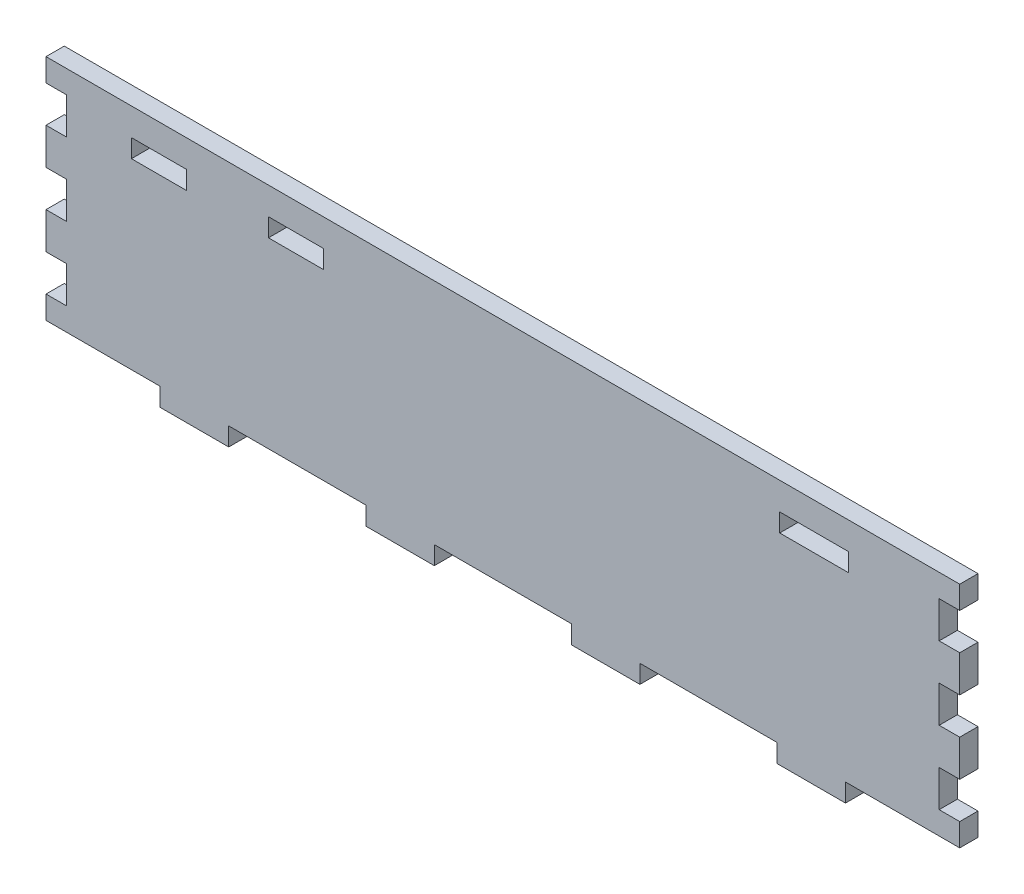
ISO-10303-21;
HEADER;
FILE_DESCRIPTION(('STEP AP214'),'2;1');
FILE_NAME('part.step','',(''),(''),'','','');
FILE_SCHEMA(('AUTOMOTIVE_DESIGN { 1 0 10303 214 1 1 1 1 }'));
ENDSEC;
DATA;
#1=APPLICATION_CONTEXT('core data for automotive mechanical design processes');
#2=APPLICATION_PROTOCOL_DEFINITION('international standard','automotive_design',2000,#1);
#3=PRODUCT_CONTEXT('',#1,'mechanical');
#4=PRODUCT('Part','Part','',(#3));
#5=PRODUCT_RELATED_PRODUCT_CATEGORY('part','',(#4));
#6=PRODUCT_DEFINITION_FORMATION('','',#4);
#7=PRODUCT_DEFINITION_CONTEXT('part definition',#1,'design');
#8=PRODUCT_DEFINITION('design','',#6,#7);
#9=PRODUCT_DEFINITION_SHAPE('','',#8);
#10=(LENGTH_UNIT() NAMED_UNIT(*) SI_UNIT(.MILLI.,.METRE.));
#11=(NAMED_UNIT(*) PLANE_ANGLE_UNIT() SI_UNIT($,.RADIAN.));
#12=(NAMED_UNIT(*) SI_UNIT($,.STERADIAN.) SOLID_ANGLE_UNIT());
#13=UNCERTAINTY_MEASURE_WITH_UNIT(LENGTH_MEASURE(1.E-05),#10,'distance_accuracy_value','');
#14=(GEOMETRIC_REPRESENTATION_CONTEXT(3) GLOBAL_UNCERTAINTY_ASSIGNED_CONTEXT((#13)) GLOBAL_UNIT_ASSIGNED_CONTEXT((#10,
#11,#12)) REPRESENTATION_CONTEXT('',''));
#15=CARTESIAN_POINT('',(0.,0.,0.));
#16=DIRECTION('',(0.,0.,1.));
#17=DIRECTION('',(1.,0.,0.));
#18=AXIS2_PLACEMENT_3D('',#15,#16,#17);
#19=CARTESIAN_POINT('',(0.,0.,2.));
#20=DIRECTION('',(0.,0.,1.));
#21=DIRECTION('',(1.,0.,0.));
#22=AXIS2_PLACEMENT_3D('',#19,#20,#21);
#23=PLANE('',#22);
#24=DIRECTION('',(-1.,0.,0.));
#25=VECTOR('',#24,1.);
#26=CARTESIAN_POINT('',(-69.3,44.,2.));
#27=LINE('',#26,#25);
#28=CARTESIAN_POINT('',(-69.3,44.,2.));
#29=VERTEX_POINT('',#28);
#30=CARTESIAN_POINT('',(-81.3,44.,2.));
#31=VERTEX_POINT('',#30);
#32=EDGE_CURVE('E423',#29,#31,#27,.T.);
#33=ORIENTED_EDGE('',*,*,#32,.F.);
#34=DIRECTION('',(0.,1.,0.));
#35=VECTOR('',#34,1.);
#36=CARTESIAN_POINT('',(-69.3,40.,2.));
#37=LINE('',#36,#35);
#38=CARTESIAN_POINT('',(-69.3,40.,2.));
#39=VERTEX_POINT('',#38);
#40=EDGE_CURVE('E421',#39,#29,#37,.T.);
#41=ORIENTED_EDGE('',*,*,#40,.F.);
#42=DIRECTION('',(1.,0.,0.));
#43=VECTOR('',#42,1.);
#44=CARTESIAN_POINT('',(-69.3,40.,2.));
#45=LINE('',#44,#43);
#46=CARTESIAN_POINT('',(-81.3,40.,2.));
#47=VERTEX_POINT('',#46);
#48=EDGE_CURVE('E429',#47,#39,#45,.T.);
#49=ORIENTED_EDGE('',*,*,#48,.F.);
#50=DIRECTION('',(0.,-1.,0.));
#51=VECTOR('',#50,1.);
#52=CARTESIAN_POINT('',(-81.3,40.,2.));
#53=LINE('',#52,#51);
#54=EDGE_CURVE('E426',#31,#47,#53,.T.);
#55=ORIENTED_EDGE('',*,*,#54,.F.);
#56=EDGE_LOOP('',(#33,#41,#49,#55));
#57=FACE_BOUND('',#56,.T.);
#58=DIRECTION('',(0.,-1.,0.));
#59=VECTOR('',#58,1.);
#60=CARTESIAN_POINT('',(-100.,50.,2.));
#61=LINE('',#60,#59);
#62=CARTESIAN_POINT('',(-100.,50.,2.));
#63=VERTEX_POINT('',#62);
#64=CARTESIAN_POINT('',(-100.,45.,2.));
#65=VERTEX_POINT('',#64);
#66=EDGE_CURVE('E483',#63,#65,#61,.T.);
#67=ORIENTED_EDGE('',*,*,#66,.T.);
#68=DIRECTION('',(1.,0.,0.));
#69=VECTOR('',#68,1.);
#70=CARTESIAN_POINT('',(-100.,45.,2.));
#71=LINE('',#70,#69);
#72=CARTESIAN_POINT('',(-95.5,45.,2.));
#73=VERTEX_POINT('',#72);
#74=EDGE_CURVE('E486',#65,#73,#71,.T.);
#75=ORIENTED_EDGE('',*,*,#74,.T.);
#76=DIRECTION('',(0.,-1.,0.));
#77=VECTOR('',#76,1.);
#78=CARTESIAN_POINT('',(-95.5,45.,2.));
#79=LINE('',#78,#77);
#80=CARTESIAN_POINT('',(-95.5,37.,2.));
#81=VERTEX_POINT('',#80);
#82=EDGE_CURVE('E489',#73,#81,#79,.T.);
#83=ORIENTED_EDGE('',*,*,#82,.T.);
#84=DIRECTION('',(-1.,0.,0.));
#85=VECTOR('',#84,1.);
#86=CARTESIAN_POINT('',(-100.,37.,2.));
#87=LINE('',#86,#85);
#88=CARTESIAN_POINT('',(-100.,37.,2.));
#89=VERTEX_POINT('',#88);
#90=EDGE_CURVE('E491',#81,#89,#87,.T.);
#91=ORIENTED_EDGE('',*,*,#90,.T.);
#92=DIRECTION('',(0.,-1.,0.));
#93=VECTOR('',#92,1.);
#94=CARTESIAN_POINT('',(-100.,37.,2.));
#95=LINE('',#94,#93);
#96=CARTESIAN_POINT('',(-100.,29.,2.));
#97=VERTEX_POINT('',#96);
#98=EDGE_CURVE('E493',#89,#97,#95,.T.);
#99=ORIENTED_EDGE('',*,*,#98,.T.);
#100=DIRECTION('',(1.,0.,0.));
#101=VECTOR('',#100,1.);
#102=CARTESIAN_POINT('',(-100.,29.,2.));
#103=LINE('',#102,#101);
#104=CARTESIAN_POINT('',(-95.5,29.,2.));
#105=VERTEX_POINT('',#104);
#106=EDGE_CURVE('E495',#97,#105,#103,.T.);
#107=ORIENTED_EDGE('',*,*,#106,.T.);
#108=DIRECTION('',(0.,-1.,0.));
#109=VECTOR('',#108,1.);
#110=CARTESIAN_POINT('',(-95.5,29.,2.));
#111=LINE('',#110,#109);
#112=CARTESIAN_POINT('',(-95.5,21.,2.));
#113=VERTEX_POINT('',#112);
#114=EDGE_CURVE('E497',#105,#113,#111,.T.);
#115=ORIENTED_EDGE('',*,*,#114,.T.);
#116=DIRECTION('',(-1.,0.,0.));
#117=VECTOR('',#116,1.);
#118=CARTESIAN_POINT('',(-100.,21.,2.));
#119=LINE('',#118,#117);
#120=CARTESIAN_POINT('',(-100.,21.,2.));
#121=VERTEX_POINT('',#120);
#122=EDGE_CURVE('E499',#113,#121,#119,.T.);
#123=ORIENTED_EDGE('',*,*,#122,.T.);
#124=DIRECTION('',(0.,-1.,0.));
#125=VECTOR('',#124,1.);
#126=CARTESIAN_POINT('',(-100.,21.,2.));
#127=LINE('',#126,#125);
#128=CARTESIAN_POINT('',(-100.,13.,2.));
#129=VERTEX_POINT('',#128);
#130=EDGE_CURVE('E501',#121,#129,#127,.T.);
#131=ORIENTED_EDGE('',*,*,#130,.T.);
#132=DIRECTION('',(1.,0.,0.));
#133=VECTOR('',#132,1.);
#134=CARTESIAN_POINT('',(-100.,13.,2.));
#135=LINE('',#134,#133);
#136=CARTESIAN_POINT('',(-95.5,13.,2.));
#137=VERTEX_POINT('',#136);
#138=EDGE_CURVE('E503',#129,#137,#135,.T.);
#139=ORIENTED_EDGE('',*,*,#138,.T.);
#140=DIRECTION('',(0.,-1.,0.));
#141=VECTOR('',#140,1.);
#142=CARTESIAN_POINT('',(-95.5,13.,2.));
#143=LINE('',#142,#141);
#144=CARTESIAN_POINT('',(-95.5,5.,2.));
#145=VERTEX_POINT('',#144);
#146=EDGE_CURVE('E505',#137,#145,#143,.T.);
#147=ORIENTED_EDGE('',*,*,#146,.T.);
#148=DIRECTION('',(-1.,0.,0.));
#149=VECTOR('',#148,1.);
#150=CARTESIAN_POINT('',(-100.,5.,2.));
#151=LINE('',#150,#149);
#152=CARTESIAN_POINT('',(-100.,5.,2.));
#153=VERTEX_POINT('',#152);
#154=EDGE_CURVE('E507',#145,#153,#151,.T.);
#155=ORIENTED_EDGE('',*,*,#154,.T.);
#156=DIRECTION('',(0.,-1.,0.));
#157=VECTOR('',#156,1.);
#158=CARTESIAN_POINT('',(-100.,5.,2.));
#159=LINE('',#158,#157);
#160=CARTESIAN_POINT('',(-100.,0.,2.));
#161=VERTEX_POINT('',#160);
#162=EDGE_CURVE('E509',#153,#161,#159,.T.);
#163=ORIENTED_EDGE('',*,*,#162,.T.);
#164=DIRECTION('',(1.,0.,0.));
#165=VECTOR('',#164,1.);
#166=CARTESIAN_POINT('',(-100.,0.,2.));
#167=LINE('',#166,#165);
#168=CARTESIAN_POINT('',(-75.,0.,2.));
#169=VERTEX_POINT('',#168);
#170=EDGE_CURVE('E511',#161,#169,#167,.T.);
#171=ORIENTED_EDGE('',*,*,#170,.T.);
#172=DIRECTION('',(0.,-1.,0.));
#173=VECTOR('',#172,1.);
#174=CARTESIAN_POINT('',(-75.,0.,2.));
#175=LINE('',#174,#173);
#176=CARTESIAN_POINT('',(-75.,-4.,2.));
#177=VERTEX_POINT('',#176);
#178=EDGE_CURVE('E513',#169,#177,#175,.T.);
#179=ORIENTED_EDGE('',*,*,#178,.T.);
#180=DIRECTION('',(1.,0.,0.));
#181=VECTOR('',#180,1.);
#182=CARTESIAN_POINT('',(-75.,-4.,2.));
#183=LINE('',#182,#181);
#184=CARTESIAN_POINT('',(-60.,-4.,2.));
#185=VERTEX_POINT('',#184);
#186=EDGE_CURVE('E515',#177,#185,#183,.T.);
#187=ORIENTED_EDGE('',*,*,#186,.T.);
#188=DIRECTION('',(0.,1.,0.));
#189=VECTOR('',#188,1.);
#190=CARTESIAN_POINT('',(-60.,0.,2.));
#191=LINE('',#190,#189);
#192=CARTESIAN_POINT('',(-60.,0.,2.));
#193=VERTEX_POINT('',#192);
#194=EDGE_CURVE('E517',#185,#193,#191,.T.);
#195=ORIENTED_EDGE('',*,*,#194,.T.);
#196=DIRECTION('',(1.,0.,0.));
#197=VECTOR('',#196,1.);
#198=CARTESIAN_POINT('',(-60.,0.,2.));
#199=LINE('',#198,#197);
#200=CARTESIAN_POINT('',(-30.,0.,2.));
#201=VERTEX_POINT('',#200);
#202=EDGE_CURVE('E519',#193,#201,#199,.T.);
#203=ORIENTED_EDGE('',*,*,#202,.T.);
#204=DIRECTION('',(0.,-1.,0.));
#205=VECTOR('',#204,1.);
#206=CARTESIAN_POINT('',(-30.,0.,2.));
#207=LINE('',#206,#205);
#208=CARTESIAN_POINT('',(-30.,-4.,2.));
#209=VERTEX_POINT('',#208);
#210=EDGE_CURVE('E521',#201,#209,#207,.T.);
#211=ORIENTED_EDGE('',*,*,#210,.T.);
#212=DIRECTION('',(1.,0.,0.));
#213=VECTOR('',#212,1.);
#214=CARTESIAN_POINT('',(-30.,-4.,2.));
#215=LINE('',#214,#213);
#216=CARTESIAN_POINT('',(-15.,-4.,2.));
#217=VERTEX_POINT('',#216);
#218=EDGE_CURVE('E523',#209,#217,#215,.T.);
#219=ORIENTED_EDGE('',*,*,#218,.T.);
#220=DIRECTION('',(0.,1.,0.));
#221=VECTOR('',#220,1.);
#222=CARTESIAN_POINT('',(-15.,0.,2.));
#223=LINE('',#222,#221);
#224=CARTESIAN_POINT('',(-15.,0.,2.));
#225=VERTEX_POINT('',#224);
#226=EDGE_CURVE('E525',#217,#225,#223,.T.);
#227=ORIENTED_EDGE('',*,*,#226,.T.);
#228=DIRECTION('',(1.,0.,0.));
#229=VECTOR('',#228,1.);
#230=CARTESIAN_POINT('',(-15.,0.,2.));
#231=LINE('',#230,#229);
#232=CARTESIAN_POINT('',(15.,0.,2.));
#233=VERTEX_POINT('',#232);
#234=EDGE_CURVE('E527',#225,#233,#231,.T.);
#235=ORIENTED_EDGE('',*,*,#234,.T.);
#236=DIRECTION('',(0.,-1.,0.));
#237=VECTOR('',#236,1.);
#238=CARTESIAN_POINT('',(15.,0.,2.));
#239=LINE('',#238,#237);
#240=CARTESIAN_POINT('',(15.,-4.,2.));
#241=VERTEX_POINT('',#240);
#242=EDGE_CURVE('E529',#233,#241,#239,.T.);
#243=ORIENTED_EDGE('',*,*,#242,.T.);
#244=DIRECTION('',(1.,0.,0.));
#245=VECTOR('',#244,1.);
#246=CARTESIAN_POINT('',(15.,-4.,2.));
#247=LINE('',#246,#245);
#248=CARTESIAN_POINT('',(30.,-4.,2.));
#249=VERTEX_POINT('',#248);
#250=EDGE_CURVE('E531',#241,#249,#247,.T.);
#251=ORIENTED_EDGE('',*,*,#250,.T.);
#252=DIRECTION('',(0.,1.,0.));
#253=VECTOR('',#252,1.);
#254=CARTESIAN_POINT('',(30.,0.,2.));
#255=LINE('',#254,#253);
#256=CARTESIAN_POINT('',(30.,0.,2.));
#257=VERTEX_POINT('',#256);
#258=EDGE_CURVE('E533',#249,#257,#255,.T.);
#259=ORIENTED_EDGE('',*,*,#258,.T.);
#260=DIRECTION('',(1.,0.,0.));
#261=VECTOR('',#260,1.);
#262=CARTESIAN_POINT('',(30.,0.,2.));
#263=LINE('',#262,#261);
#264=CARTESIAN_POINT('',(60.,0.,2.));
#265=VERTEX_POINT('',#264);
#266=EDGE_CURVE('E535',#257,#265,#263,.T.);
#267=ORIENTED_EDGE('',*,*,#266,.T.);
#268=DIRECTION('',(0.,-1.,0.));
#269=VECTOR('',#268,1.);
#270=CARTESIAN_POINT('',(60.,0.,2.));
#271=LINE('',#270,#269);
#272=CARTESIAN_POINT('',(60.,-4.,2.));
#273=VERTEX_POINT('',#272);
#274=EDGE_CURVE('E537',#265,#273,#271,.T.);
#275=ORIENTED_EDGE('',*,*,#274,.T.);
#276=DIRECTION('',(1.,0.,0.));
#277=VECTOR('',#276,1.);
#278=CARTESIAN_POINT('',(60.,-4.,2.));
#279=LINE('',#278,#277);
#280=CARTESIAN_POINT('',(75.,-4.,2.));
#281=VERTEX_POINT('',#280);
#282=EDGE_CURVE('E539',#273,#281,#279,.T.);
#283=ORIENTED_EDGE('',*,*,#282,.T.);
#284=DIRECTION('',(0.,1.,0.));
#285=VECTOR('',#284,1.);
#286=CARTESIAN_POINT('',(75.,0.,2.));
#287=LINE('',#286,#285);
#288=CARTESIAN_POINT('',(75.,0.,2.));
#289=VERTEX_POINT('',#288);
#290=EDGE_CURVE('E541',#281,#289,#287,.T.);
#291=ORIENTED_EDGE('',*,*,#290,.T.);
#292=DIRECTION('',(1.,0.,0.));
#293=VECTOR('',#292,1.);
#294=CARTESIAN_POINT('',(75.,0.,2.));
#295=LINE('',#294,#293);
#296=CARTESIAN_POINT('',(100.,0.,2.));
#297=VERTEX_POINT('',#296);
#298=EDGE_CURVE('E543',#289,#297,#295,.T.);
#299=ORIENTED_EDGE('',*,*,#298,.T.);
#300=DIRECTION('',(0.,1.,0.));
#301=VECTOR('',#300,1.);
#302=CARTESIAN_POINT('',(100.,5.,2.));
#303=LINE('',#302,#301);
#304=CARTESIAN_POINT('',(100.,5.,2.));
#305=VERTEX_POINT('',#304);
#306=EDGE_CURVE('E545',#297,#305,#303,.T.);
#307=ORIENTED_EDGE('',*,*,#306,.T.);
#308=DIRECTION('',(-1.,0.,0.));
#309=VECTOR('',#308,1.);
#310=CARTESIAN_POINT('',(100.,5.,2.));
#311=LINE('',#310,#309);
#312=CARTESIAN_POINT('',(95.5,5.,2.));
#313=VERTEX_POINT('',#312);
#314=EDGE_CURVE('E547',#305,#313,#311,.T.);
#315=ORIENTED_EDGE('',*,*,#314,.T.);
#316=DIRECTION('',(0.,1.,0.));
#317=VECTOR('',#316,1.);
#318=CARTESIAN_POINT('',(95.5,5.,2.));
#319=LINE('',#318,#317);
#320=CARTESIAN_POINT('',(95.5,13.,2.));
#321=VERTEX_POINT('',#320);
#322=EDGE_CURVE('E549',#313,#321,#319,.T.);
#323=ORIENTED_EDGE('',*,*,#322,.T.);
#324=DIRECTION('',(1.,0.,0.));
#325=VECTOR('',#324,1.);
#326=CARTESIAN_POINT('',(100.,13.,2.));
#327=LINE('',#326,#325);
#328=CARTESIAN_POINT('',(100.,13.,2.));
#329=VERTEX_POINT('',#328);
#330=EDGE_CURVE('E551',#321,#329,#327,.T.);
#331=ORIENTED_EDGE('',*,*,#330,.T.);
#332=DIRECTION('',(0.,1.,0.));
#333=VECTOR('',#332,1.);
#334=CARTESIAN_POINT('',(100.,21.,2.));
#335=LINE('',#334,#333);
#336=CARTESIAN_POINT('',(100.,21.,2.));
#337=VERTEX_POINT('',#336);
#338=EDGE_CURVE('E553',#329,#337,#335,.T.);
#339=ORIENTED_EDGE('',*,*,#338,.T.);
#340=DIRECTION('',(-1.,0.,0.));
#341=VECTOR('',#340,1.);
#342=CARTESIAN_POINT('',(100.,21.,2.));
#343=LINE('',#342,#341);
#344=CARTESIAN_POINT('',(95.5,21.,2.));
#345=VERTEX_POINT('',#344);
#346=EDGE_CURVE('E555',#337,#345,#343,.T.);
#347=ORIENTED_EDGE('',*,*,#346,.T.);
#348=DIRECTION('',(0.,1.,0.));
#349=VECTOR('',#348,1.);
#350=CARTESIAN_POINT('',(95.5,21.,2.));
#351=LINE('',#350,#349);
#352=CARTESIAN_POINT('',(95.5,29.,2.));
#353=VERTEX_POINT('',#352);
#354=EDGE_CURVE('E557',#345,#353,#351,.T.);
#355=ORIENTED_EDGE('',*,*,#354,.T.);
#356=DIRECTION('',(1.,0.,0.));
#357=VECTOR('',#356,1.);
#358=CARTESIAN_POINT('',(100.,29.,2.));
#359=LINE('',#358,#357);
#360=CARTESIAN_POINT('',(100.,29.,2.));
#361=VERTEX_POINT('',#360);
#362=EDGE_CURVE('E559',#353,#361,#359,.T.);
#363=ORIENTED_EDGE('',*,*,#362,.T.);
#364=DIRECTION('',(0.,1.,0.));
#365=VECTOR('',#364,1.);
#366=CARTESIAN_POINT('',(100.,37.,2.));
#367=LINE('',#366,#365);
#368=CARTESIAN_POINT('',(100.,37.,2.));
#369=VERTEX_POINT('',#368);
#370=EDGE_CURVE('E561',#361,#369,#367,.T.);
#371=ORIENTED_EDGE('',*,*,#370,.T.);
#372=DIRECTION('',(-1.,0.,0.));
#373=VECTOR('',#372,1.);
#374=CARTESIAN_POINT('',(100.,37.,2.));
#375=LINE('',#374,#373);
#376=CARTESIAN_POINT('',(95.5,37.,2.));
#377=VERTEX_POINT('',#376);
#378=EDGE_CURVE('E563',#369,#377,#375,.T.);
#379=ORIENTED_EDGE('',*,*,#378,.T.);
#380=DIRECTION('',(0.,1.,0.));
#381=VECTOR('',#380,1.);
#382=CARTESIAN_POINT('',(95.5,37.,2.));
#383=LINE('',#382,#381);
#384=CARTESIAN_POINT('',(95.5,45.,2.));
#385=VERTEX_POINT('',#384);
#386=EDGE_CURVE('E565',#377,#385,#383,.T.);
#387=ORIENTED_EDGE('',*,*,#386,.T.);
#388=DIRECTION('',(1.,0.,0.));
#389=VECTOR('',#388,1.);
#390=CARTESIAN_POINT('',(100.,45.,2.));
#391=LINE('',#390,#389);
#392=CARTESIAN_POINT('',(100.,45.,2.));
#393=VERTEX_POINT('',#392);
#394=EDGE_CURVE('E567',#385,#393,#391,.T.);
#395=ORIENTED_EDGE('',*,*,#394,.T.);
#396=DIRECTION('',(0.,1.,0.));
#397=VECTOR('',#396,1.);
#398=CARTESIAN_POINT('',(100.,50.,2.));
#399=LINE('',#398,#397);
#400=CARTESIAN_POINT('',(100.,50.,2.));
#401=VERTEX_POINT('',#400);
#402=EDGE_CURVE('E569',#393,#401,#399,.T.);
#403=ORIENTED_EDGE('',*,*,#402,.T.);
#404=DIRECTION('',(-1.,0.,0.));
#405=VECTOR('',#404,1.);
#406=CARTESIAN_POINT('',(-100.,50.,2.));
#407=LINE('',#406,#405);
#408=EDGE_CURVE('E571',#401,#63,#407,.T.);
#409=ORIENTED_EDGE('',*,*,#408,.T.);
#410=EDGE_LOOP('',(#67,#75,#83,#91,#99,#107,#115,#123,#131,#139,#147,#155,#163,#171,#179,#187,
#195,#203,#211,#219,#227,#235,#243,#251,#259,#267,#275,#283,#291,#299,#307,#315,#323,#331,#339,
#347,#355,#363,#371,#379,#387,#395,#403,#409));
#411=FACE_BOUND('',#410,.T.);
#412=DIRECTION('',(-1.,0.,0.));
#413=VECTOR('',#412,1.);
#414=CARTESIAN_POINT('',(-39.3,44.,2.));
#415=LINE('',#414,#413);
#416=CARTESIAN_POINT('',(-39.3,44.,2.));
#417=VERTEX_POINT('',#416);
#418=CARTESIAN_POINT('',(-51.3,44.,2.));
#419=VERTEX_POINT('',#418);
#420=EDGE_CURVE('E454',#417,#419,#415,.T.);
#421=ORIENTED_EDGE('',*,*,#420,.F.);
#422=DIRECTION('',(0.,1.,0.));
#423=VECTOR('',#422,1.);
#424=CARTESIAN_POINT('',(-39.3,40.,2.));
#425=LINE('',#424,#423);
#426=CARTESIAN_POINT('',(-39.3,40.,2.));
#427=VERTEX_POINT('',#426);
#428=EDGE_CURVE('E452',#427,#417,#425,.T.);
#429=ORIENTED_EDGE('',*,*,#428,.F.);
#430=DIRECTION('',(1.,0.,0.));
#431=VECTOR('',#430,1.);
#432=CARTESIAN_POINT('',(-39.3,40.,2.));
#433=LINE('',#432,#431);
#434=CARTESIAN_POINT('',(-51.3,40.,2.));
#435=VERTEX_POINT('',#434);
#436=EDGE_CURVE('E460',#435,#427,#433,.T.);
#437=ORIENTED_EDGE('',*,*,#436,.F.);
#438=DIRECTION('',(0.,-1.,0.));
#439=VECTOR('',#438,1.);
#440=CARTESIAN_POINT('',(-51.3,40.,2.));
#441=LINE('',#440,#439);
#442=EDGE_CURVE('E457',#419,#435,#441,.T.);
#443=ORIENTED_EDGE('',*,*,#442,.F.);
#444=EDGE_LOOP('',(#421,#429,#437,#443));
#445=FACE_BOUND('',#444,.T.);
#446=DIRECTION('',(1.,0.,0.));
#447=VECTOR('',#446,1.);
#448=CARTESIAN_POINT('',(60.6,40.,2.));
#449=LINE('',#448,#447);
#450=CARTESIAN_POINT('',(60.6,40.,2.));
#451=VERTEX_POINT('',#450);
#452=CARTESIAN_POINT('',(75.6,40.,2.));
#453=VERTEX_POINT('',#452);
#454=EDGE_CURVE('E393',#451,#453,#449,.T.);
#455=ORIENTED_EDGE('',*,*,#454,.F.);
#456=DIRECTION('',(0.,-1.,0.));
#457=VECTOR('',#456,1.);
#458=CARTESIAN_POINT('',(60.6,44.,2.));
#459=LINE('',#458,#457);
#460=CARTESIAN_POINT('',(60.6,44.,2.));
#461=VERTEX_POINT('',#460);
#462=EDGE_CURVE('E385',#461,#451,#459,.T.);
#463=ORIENTED_EDGE('',*,*,#462,.F.);
#464=DIRECTION('',(-1.,0.,0.));
#465=VECTOR('',#464,1.);
#466=CARTESIAN_POINT('',(60.6,44.,2.));
#467=LINE('',#466,#465);
#468=CARTESIAN_POINT('',(75.6,44.,2.));
#469=VERTEX_POINT('',#468);
#470=EDGE_CURVE('E407',#469,#461,#467,.T.);
#471=ORIENTED_EDGE('',*,*,#470,.F.);
#472=DIRECTION('',(0.,1.,0.));
#473=VECTOR('',#472,1.);
#474=CARTESIAN_POINT('',(75.6,44.,2.));
#475=LINE('',#474,#473);
#476=EDGE_CURVE('E405',#453,#469,#475,.T.);
#477=ORIENTED_EDGE('',*,*,#476,.F.);
#478=EDGE_LOOP('',(#455,#463,#471,#477));
#479=FACE_BOUND('',#478,.T.);
#480=ADVANCED_FACE('F32',(#57,#411,#445,#479),#23,.T.);
#481=CARTESIAN_POINT('',(0.,0.,-2.));
#482=DIRECTION('',(0.,0.,1.));
#483=DIRECTION('',(1.,0.,0.));
#484=AXIS2_PLACEMENT_3D('',#481,#482,#483);
#485=PLANE('',#484);
#486=DIRECTION('',(0.,1.,0.));
#487=VECTOR('',#486,1.);
#488=CARTESIAN_POINT('',(-69.3,40.,-2.));
#489=LINE('',#488,#487);
#490=CARTESIAN_POINT('',(-69.3,40.,-2.));
#491=VERTEX_POINT('',#490);
#492=CARTESIAN_POINT('',(-69.3,44.,-2.));
#493=VERTEX_POINT('',#492);
#494=EDGE_CURVE('E401',#491,#493,#489,.T.);
#495=ORIENTED_EDGE('',*,*,#494,.T.);
#496=DIRECTION('',(-1.,0.,0.));
#497=VECTOR('',#496,1.);
#498=CARTESIAN_POINT('',(-69.3,44.,-2.));
#499=LINE('',#498,#497);
#500=CARTESIAN_POINT('',(-81.3,44.,-2.));
#501=VERTEX_POINT('',#500);
#502=EDGE_CURVE('E434',#493,#501,#499,.T.);
#503=ORIENTED_EDGE('',*,*,#502,.T.);
#504=DIRECTION('',(0.,-1.,0.));
#505=VECTOR('',#504,1.);
#506=CARTESIAN_POINT('',(-81.3,40.,-2.));
#507=LINE('',#506,#505);
#508=CARTESIAN_POINT('',(-81.3,40.,-2.));
#509=VERTEX_POINT('',#508);
#510=EDGE_CURVE('E437',#501,#509,#507,.T.);
#511=ORIENTED_EDGE('',*,*,#510,.T.);
#512=DIRECTION('',(1.,0.,0.));
#513=VECTOR('',#512,1.);
#514=CARTESIAN_POINT('',(-69.3,40.,-2.));
#515=LINE('',#514,#513);
#516=EDGE_CURVE('E424',#509,#491,#515,.T.);
#517=ORIENTED_EDGE('',*,*,#516,.T.);
#518=EDGE_LOOP('',(#495,#503,#511,#517));
#519=FACE_BOUND('',#518,.T.);
#520=DIRECTION('',(0.,-1.,0.));
#521=VECTOR('',#520,1.);
#522=CARTESIAN_POINT('',(-100.,50.,-2.));
#523=LINE('',#522,#521);
#524=CARTESIAN_POINT('',(-100.,50.,-2.));
#525=VERTEX_POINT('',#524);
#526=CARTESIAN_POINT('',(-100.,45.,-2.));
#527=VERTEX_POINT('',#526);
#528=EDGE_CURVE('E482',#525,#527,#523,.T.);
#529=ORIENTED_EDGE('',*,*,#528,.F.);
#530=DIRECTION('',(-1.,0.,0.));
#531=VECTOR('',#530,1.);
#532=CARTESIAN_POINT('',(-100.,50.,-2.));
#533=LINE('',#532,#531);
#534=CARTESIAN_POINT('',(100.,50.,-2.));
#535=VERTEX_POINT('',#534);
#536=EDGE_CURVE('E487',#535,#525,#533,.T.);
#537=ORIENTED_EDGE('',*,*,#536,.F.);
#538=DIRECTION('',(0.,1.,0.));
#539=VECTOR('',#538,1.);
#540=CARTESIAN_POINT('',(100.,50.,-2.));
#541=LINE('',#540,#539);
#542=CARTESIAN_POINT('',(100.,45.,-2.));
#543=VERTEX_POINT('',#542);
#544=EDGE_CURVE('E658',#543,#535,#541,.T.);
#545=ORIENTED_EDGE('',*,*,#544,.F.);
#546=DIRECTION('',(1.,0.,0.));
#547=VECTOR('',#546,1.);
#548=CARTESIAN_POINT('',(100.,45.,-2.));
#549=LINE('',#548,#547);
#550=CARTESIAN_POINT('',(95.5,45.,-2.));
#551=VERTEX_POINT('',#550);
#552=EDGE_CURVE('E656',#551,#543,#549,.T.);
#553=ORIENTED_EDGE('',*,*,#552,.F.);
#554=DIRECTION('',(0.,1.,0.));
#555=VECTOR('',#554,1.);
#556=CARTESIAN_POINT('',(95.5,37.,-2.));
#557=LINE('',#556,#555);
#558=CARTESIAN_POINT('',(95.5,37.,-2.));
#559=VERTEX_POINT('',#558);
#560=EDGE_CURVE('E654',#559,#551,#557,.T.);
#561=ORIENTED_EDGE('',*,*,#560,.F.);
#562=DIRECTION('',(-1.,0.,0.));
#563=VECTOR('',#562,1.);
#564=CARTESIAN_POINT('',(100.,37.,-2.));
#565=LINE('',#564,#563);
#566=CARTESIAN_POINT('',(100.,37.,-2.));
#567=VERTEX_POINT('',#566);
#568=EDGE_CURVE('E652',#567,#559,#565,.T.);
#569=ORIENTED_EDGE('',*,*,#568,.F.);
#570=DIRECTION('',(0.,1.,0.));
#571=VECTOR('',#570,1.);
#572=CARTESIAN_POINT('',(100.,37.,-2.));
#573=LINE('',#572,#571);
#574=CARTESIAN_POINT('',(100.,29.,-2.));
#575=VERTEX_POINT('',#574);
#576=EDGE_CURVE('E650',#575,#567,#573,.T.);
#577=ORIENTED_EDGE('',*,*,#576,.F.);
#578=DIRECTION('',(1.,0.,0.));
#579=VECTOR('',#578,1.);
#580=CARTESIAN_POINT('',(100.,29.,-2.));
#581=LINE('',#580,#579);
#582=CARTESIAN_POINT('',(95.5,29.,-2.));
#583=VERTEX_POINT('',#582);
#584=EDGE_CURVE('E648',#583,#575,#581,.T.);
#585=ORIENTED_EDGE('',*,*,#584,.F.);
#586=DIRECTION('',(0.,1.,0.));
#587=VECTOR('',#586,1.);
#588=CARTESIAN_POINT('',(95.5,21.,-2.));
#589=LINE('',#588,#587);
#590=CARTESIAN_POINT('',(95.5,21.,-2.));
#591=VERTEX_POINT('',#590);
#592=EDGE_CURVE('E646',#591,#583,#589,.T.);
#593=ORIENTED_EDGE('',*,*,#592,.F.);
#594=DIRECTION('',(-1.,0.,0.));
#595=VECTOR('',#594,1.);
#596=CARTESIAN_POINT('',(100.,21.,-2.));
#597=LINE('',#596,#595);
#598=CARTESIAN_POINT('',(100.,21.,-2.));
#599=VERTEX_POINT('',#598);
#600=EDGE_CURVE('E644',#599,#591,#597,.T.);
#601=ORIENTED_EDGE('',*,*,#600,.F.);
#602=DIRECTION('',(0.,1.,0.));
#603=VECTOR('',#602,1.);
#604=CARTESIAN_POINT('',(100.,21.,-2.));
#605=LINE('',#604,#603);
#606=CARTESIAN_POINT('',(100.,13.,-2.));
#607=VERTEX_POINT('',#606);
#608=EDGE_CURVE('E642',#607,#599,#605,.T.);
#609=ORIENTED_EDGE('',*,*,#608,.F.);
#610=DIRECTION('',(1.,0.,0.));
#611=VECTOR('',#610,1.);
#612=CARTESIAN_POINT('',(100.,13.,-2.));
#613=LINE('',#612,#611);
#614=CARTESIAN_POINT('',(95.5,13.,-2.));
#615=VERTEX_POINT('',#614);
#616=EDGE_CURVE('E640',#615,#607,#613,.T.);
#617=ORIENTED_EDGE('',*,*,#616,.F.);
#618=DIRECTION('',(0.,1.,0.));
#619=VECTOR('',#618,1.);
#620=CARTESIAN_POINT('',(95.5,5.,-2.));
#621=LINE('',#620,#619);
#622=CARTESIAN_POINT('',(95.5,5.,-2.));
#623=VERTEX_POINT('',#622);
#624=EDGE_CURVE('E638',#623,#615,#621,.T.);
#625=ORIENTED_EDGE('',*,*,#624,.F.);
#626=DIRECTION('',(-1.,0.,0.));
#627=VECTOR('',#626,1.);
#628=CARTESIAN_POINT('',(100.,5.,-2.));
#629=LINE('',#628,#627);
#630=CARTESIAN_POINT('',(100.,5.,-2.));
#631=VERTEX_POINT('',#630);
#632=EDGE_CURVE('E636',#631,#623,#629,.T.);
#633=ORIENTED_EDGE('',*,*,#632,.F.);
#634=DIRECTION('',(0.,1.,0.));
#635=VECTOR('',#634,1.);
#636=CARTESIAN_POINT('',(100.,5.,-2.));
#637=LINE('',#636,#635);
#638=CARTESIAN_POINT('',(100.,0.,-2.));
#639=VERTEX_POINT('',#638);
#640=EDGE_CURVE('E634',#639,#631,#637,.T.);
#641=ORIENTED_EDGE('',*,*,#640,.F.);
#642=DIRECTION('',(1.,0.,0.));
#643=VECTOR('',#642,1.);
#644=CARTESIAN_POINT('',(75.,0.,-2.));
#645=LINE('',#644,#643);
#646=CARTESIAN_POINT('',(75.,0.,-2.));
#647=VERTEX_POINT('',#646);
#648=EDGE_CURVE('E632',#647,#639,#645,.T.);
#649=ORIENTED_EDGE('',*,*,#648,.F.);
#650=DIRECTION('',(0.,1.,0.));
#651=VECTOR('',#650,1.);
#652=CARTESIAN_POINT('',(75.,0.,-2.));
#653=LINE('',#652,#651);
#654=CARTESIAN_POINT('',(75.,-4.,-2.));
#655=VERTEX_POINT('',#654);
#656=EDGE_CURVE('E630',#655,#647,#653,.T.);
#657=ORIENTED_EDGE('',*,*,#656,.F.);
#658=DIRECTION('',(1.,0.,0.));
#659=VECTOR('',#658,1.);
#660=CARTESIAN_POINT('',(60.,-4.,-2.));
#661=LINE('',#660,#659);
#662=CARTESIAN_POINT('',(60.,-4.,-2.));
#663=VERTEX_POINT('',#662);
#664=EDGE_CURVE('E628',#663,#655,#661,.T.);
#665=ORIENTED_EDGE('',*,*,#664,.F.);
#666=DIRECTION('',(0.,-1.,0.));
#667=VECTOR('',#666,1.);
#668=CARTESIAN_POINT('',(60.,0.,-2.));
#669=LINE('',#668,#667);
#670=CARTESIAN_POINT('',(60.,0.,-2.));
#671=VERTEX_POINT('',#670);
#672=EDGE_CURVE('E626',#671,#663,#669,.T.);
#673=ORIENTED_EDGE('',*,*,#672,.F.);
#674=DIRECTION('',(1.,0.,0.));
#675=VECTOR('',#674,1.);
#676=CARTESIAN_POINT('',(30.,0.,-2.));
#677=LINE('',#676,#675);
#678=CARTESIAN_POINT('',(30.,0.,-2.));
#679=VERTEX_POINT('',#678);
#680=EDGE_CURVE('E624',#679,#671,#677,.T.);
#681=ORIENTED_EDGE('',*,*,#680,.F.);
#682=DIRECTION('',(0.,1.,0.));
#683=VECTOR('',#682,1.);
#684=CARTESIAN_POINT('',(30.,0.,-2.));
#685=LINE('',#684,#683);
#686=CARTESIAN_POINT('',(30.,-4.,-2.));
#687=VERTEX_POINT('',#686);
#688=EDGE_CURVE('E622',#687,#679,#685,.T.);
#689=ORIENTED_EDGE('',*,*,#688,.F.);
#690=DIRECTION('',(1.,0.,0.));
#691=VECTOR('',#690,1.);
#692=CARTESIAN_POINT('',(15.,-4.,-2.));
#693=LINE('',#692,#691);
#694=CARTESIAN_POINT('',(15.,-4.,-2.));
#695=VERTEX_POINT('',#694);
#696=EDGE_CURVE('E620',#695,#687,#693,.T.);
#697=ORIENTED_EDGE('',*,*,#696,.F.);
#698=DIRECTION('',(0.,-1.,0.));
#699=VECTOR('',#698,1.);
#700=CARTESIAN_POINT('',(15.,0.,-2.));
#701=LINE('',#700,#699);
#702=CARTESIAN_POINT('',(15.,0.,-2.));
#703=VERTEX_POINT('',#702);
#704=EDGE_CURVE('E618',#703,#695,#701,.T.);
#705=ORIENTED_EDGE('',*,*,#704,.F.);
#706=DIRECTION('',(1.,0.,0.));
#707=VECTOR('',#706,1.);
#708=CARTESIAN_POINT('',(-15.,0.,-2.));
#709=LINE('',#708,#707);
#710=CARTESIAN_POINT('',(-15.,0.,-2.));
#711=VERTEX_POINT('',#710);
#712=EDGE_CURVE('E616',#711,#703,#709,.T.);
#713=ORIENTED_EDGE('',*,*,#712,.F.);
#714=DIRECTION('',(0.,1.,0.));
#715=VECTOR('',#714,1.);
#716=CARTESIAN_POINT('',(-15.,0.,-2.));
#717=LINE('',#716,#715);
#718=CARTESIAN_POINT('',(-15.,-4.,-2.));
#719=VERTEX_POINT('',#718);
#720=EDGE_CURVE('E614',#719,#711,#717,.T.);
#721=ORIENTED_EDGE('',*,*,#720,.F.);
#722=DIRECTION('',(1.,0.,0.));
#723=VECTOR('',#722,1.);
#724=CARTESIAN_POINT('',(-30.,-4.,-2.));
#725=LINE('',#724,#723);
#726=CARTESIAN_POINT('',(-30.,-4.,-2.));
#727=VERTEX_POINT('',#726);
#728=EDGE_CURVE('E612',#727,#719,#725,.T.);
#729=ORIENTED_EDGE('',*,*,#728,.F.);
#730=DIRECTION('',(0.,-1.,0.));
#731=VECTOR('',#730,1.);
#732=CARTESIAN_POINT('',(-30.,0.,-2.));
#733=LINE('',#732,#731);
#734=CARTESIAN_POINT('',(-30.,0.,-2.));
#735=VERTEX_POINT('',#734);
#736=EDGE_CURVE('E610',#735,#727,#733,.T.);
#737=ORIENTED_EDGE('',*,*,#736,.F.);
#738=DIRECTION('',(1.,0.,0.));
#739=VECTOR('',#738,1.);
#740=CARTESIAN_POINT('',(-60.,0.,-2.));
#741=LINE('',#740,#739);
#742=CARTESIAN_POINT('',(-60.,0.,-2.));
#743=VERTEX_POINT('',#742);
#744=EDGE_CURVE('E608',#743,#735,#741,.T.);
#745=ORIENTED_EDGE('',*,*,#744,.F.);
#746=DIRECTION('',(0.,1.,0.));
#747=VECTOR('',#746,1.);
#748=CARTESIAN_POINT('',(-60.,0.,-2.));
#749=LINE('',#748,#747);
#750=CARTESIAN_POINT('',(-60.,-4.,-2.));
#751=VERTEX_POINT('',#750);
#752=EDGE_CURVE('E606',#751,#743,#749,.T.);
#753=ORIENTED_EDGE('',*,*,#752,.F.);
#754=DIRECTION('',(1.,0.,0.));
#755=VECTOR('',#754,1.);
#756=CARTESIAN_POINT('',(-75.,-4.,-2.));
#757=LINE('',#756,#755);
#758=CARTESIAN_POINT('',(-75.,-4.,-2.));
#759=VERTEX_POINT('',#758);
#760=EDGE_CURVE('E604',#759,#751,#757,.T.);
#761=ORIENTED_EDGE('',*,*,#760,.F.);
#762=DIRECTION('',(0.,-1.,0.));
#763=VECTOR('',#762,1.);
#764=CARTESIAN_POINT('',(-75.,0.,-2.));
#765=LINE('',#764,#763);
#766=CARTESIAN_POINT('',(-75.,0.,-2.));
#767=VERTEX_POINT('',#766);
#768=EDGE_CURVE('E602',#767,#759,#765,.T.);
#769=ORIENTED_EDGE('',*,*,#768,.F.);
#770=DIRECTION('',(1.,0.,0.));
#771=VECTOR('',#770,1.);
#772=CARTESIAN_POINT('',(-100.,0.,-2.));
#773=LINE('',#772,#771);
#774=CARTESIAN_POINT('',(-100.,0.,-2.));
#775=VERTEX_POINT('',#774);
#776=EDGE_CURVE('E600',#775,#767,#773,.T.);
#777=ORIENTED_EDGE('',*,*,#776,.F.);
#778=DIRECTION('',(0.,-1.,0.));
#779=VECTOR('',#778,1.);
#780=CARTESIAN_POINT('',(-100.,5.,-2.));
#781=LINE('',#780,#779);
#782=CARTESIAN_POINT('',(-100.,5.,-2.));
#783=VERTEX_POINT('',#782);
#784=EDGE_CURVE('E598',#783,#775,#781,.T.);
#785=ORIENTED_EDGE('',*,*,#784,.F.);
#786=DIRECTION('',(-1.,0.,0.));
#787=VECTOR('',#786,1.);
#788=CARTESIAN_POINT('',(-100.,5.,-2.));
#789=LINE('',#788,#787);
#790=CARTESIAN_POINT('',(-95.5,5.,-2.));
#791=VERTEX_POINT('',#790);
#792=EDGE_CURVE('E596',#791,#783,#789,.T.);
#793=ORIENTED_EDGE('',*,*,#792,.F.);
#794=DIRECTION('',(0.,-1.,0.));
#795=VECTOR('',#794,1.);
#796=CARTESIAN_POINT('',(-95.5,13.,-2.));
#797=LINE('',#796,#795);
#798=CARTESIAN_POINT('',(-95.5,13.,-2.));
#799=VERTEX_POINT('',#798);
#800=EDGE_CURVE('E594',#799,#791,#797,.T.);
#801=ORIENTED_EDGE('',*,*,#800,.F.);
#802=DIRECTION('',(1.,0.,0.));
#803=VECTOR('',#802,1.);
#804=CARTESIAN_POINT('',(-100.,13.,-2.));
#805=LINE('',#804,#803);
#806=CARTESIAN_POINT('',(-100.,13.,-2.));
#807=VERTEX_POINT('',#806);
#808=EDGE_CURVE('E592',#807,#799,#805,.T.);
#809=ORIENTED_EDGE('',*,*,#808,.F.);
#810=DIRECTION('',(0.,-1.,0.));
#811=VECTOR('',#810,1.);
#812=CARTESIAN_POINT('',(-100.,21.,-2.));
#813=LINE('',#812,#811);
#814=CARTESIAN_POINT('',(-100.,21.,-2.));
#815=VERTEX_POINT('',#814);
#816=EDGE_CURVE('E590',#815,#807,#813,.T.);
#817=ORIENTED_EDGE('',*,*,#816,.F.);
#818=DIRECTION('',(-1.,0.,0.));
#819=VECTOR('',#818,1.);
#820=CARTESIAN_POINT('',(-100.,21.,-2.));
#821=LINE('',#820,#819);
#822=CARTESIAN_POINT('',(-95.5,21.,-2.));
#823=VERTEX_POINT('',#822);
#824=EDGE_CURVE('E588',#823,#815,#821,.T.);
#825=ORIENTED_EDGE('',*,*,#824,.F.);
#826=DIRECTION('',(0.,-1.,0.));
#827=VECTOR('',#826,1.);
#828=CARTESIAN_POINT('',(-95.5,29.,-2.));
#829=LINE('',#828,#827);
#830=CARTESIAN_POINT('',(-95.5,29.,-2.));
#831=VERTEX_POINT('',#830);
#832=EDGE_CURVE('E586',#831,#823,#829,.T.);
#833=ORIENTED_EDGE('',*,*,#832,.F.);
#834=DIRECTION('',(1.,0.,0.));
#835=VECTOR('',#834,1.);
#836=CARTESIAN_POINT('',(-100.,29.,-2.));
#837=LINE('',#836,#835);
#838=CARTESIAN_POINT('',(-100.,29.,-2.));
#839=VERTEX_POINT('',#838);
#840=EDGE_CURVE('E584',#839,#831,#837,.T.);
#841=ORIENTED_EDGE('',*,*,#840,.F.);
#842=DIRECTION('',(0.,-1.,0.));
#843=VECTOR('',#842,1.);
#844=CARTESIAN_POINT('',(-100.,37.,-2.));
#845=LINE('',#844,#843);
#846=CARTESIAN_POINT('',(-100.,37.,-2.));
#847=VERTEX_POINT('',#846);
#848=EDGE_CURVE('E582',#847,#839,#845,.T.);
#849=ORIENTED_EDGE('',*,*,#848,.F.);
#850=DIRECTION('',(-1.,0.,0.));
#851=VECTOR('',#850,1.);
#852=CARTESIAN_POINT('',(-100.,37.,-2.));
#853=LINE('',#852,#851);
#854=CARTESIAN_POINT('',(-95.5,37.,-2.));
#855=VERTEX_POINT('',#854);
#856=EDGE_CURVE('E580',#855,#847,#853,.T.);
#857=ORIENTED_EDGE('',*,*,#856,.F.);
#858=DIRECTION('',(0.,-1.,0.));
#859=VECTOR('',#858,1.);
#860=CARTESIAN_POINT('',(-95.5,45.,-2.));
#861=LINE('',#860,#859);
#862=CARTESIAN_POINT('',(-95.5,45.,-2.));
#863=VERTEX_POINT('',#862);
#864=EDGE_CURVE('E578',#863,#855,#861,.T.);
#865=ORIENTED_EDGE('',*,*,#864,.F.);
#866=DIRECTION('',(1.,0.,0.));
#867=VECTOR('',#866,1.);
#868=CARTESIAN_POINT('',(-100.,45.,-2.));
#869=LINE('',#868,#867);
#870=EDGE_CURVE('E576',#527,#863,#869,.T.);
#871=ORIENTED_EDGE('',*,*,#870,.F.);
#872=EDGE_LOOP('',(#529,#537,#545,#553,#561,#569,#577,#585,#593,#601,#609,#617,#625,#633,#641,
#649,#657,#665,#673,#681,#689,#697,#705,#713,#721,#729,#737,#745,#753,#761,#769,#777,#785,#793,
#801,#809,#817,#825,#833,#841,#849,#857,#865,#871));
#873=FACE_BOUND('',#872,.T.);
#874=DIRECTION('',(0.,1.,0.));
#875=VECTOR('',#874,1.);
#876=CARTESIAN_POINT('',(-39.3,40.,-2.));
#877=LINE('',#876,#875);
#878=CARTESIAN_POINT('',(-39.3,40.,-2.));
#879=VERTEX_POINT('',#878);
#880=CARTESIAN_POINT('',(-39.3,44.,-2.));
#881=VERTEX_POINT('',#880);
#882=EDGE_CURVE('E451',#879,#881,#877,.T.);
#883=ORIENTED_EDGE('',*,*,#882,.T.);
#884=DIRECTION('',(-1.,0.,0.));
#885=VECTOR('',#884,1.);
#886=CARTESIAN_POINT('',(-39.3,44.,-2.));
#887=LINE('',#886,#885);
#888=CARTESIAN_POINT('',(-51.3,44.,-2.));
#889=VERTEX_POINT('',#888);
#890=EDGE_CURVE('E465',#881,#889,#887,.T.);
#891=ORIENTED_EDGE('',*,*,#890,.T.);
#892=DIRECTION('',(0.,-1.,0.));
#893=VECTOR('',#892,1.);
#894=CARTESIAN_POINT('',(-51.3,40.,-2.));
#895=LINE('',#894,#893);
#896=CARTESIAN_POINT('',(-51.3,40.,-2.));
#897=VERTEX_POINT('',#896);
#898=EDGE_CURVE('E468',#889,#897,#895,.T.);
#899=ORIENTED_EDGE('',*,*,#898,.T.);
#900=DIRECTION('',(1.,0.,0.));
#901=VECTOR('',#900,1.);
#902=CARTESIAN_POINT('',(-39.3,40.,-2.));
#903=LINE('',#902,#901);
#904=EDGE_CURVE('E455',#897,#879,#903,.T.);
#905=ORIENTED_EDGE('',*,*,#904,.T.);
#906=EDGE_LOOP('',(#883,#891,#899,#905));
#907=FACE_BOUND('',#906,.T.);
#908=DIRECTION('',(0.,-1.,0.));
#909=VECTOR('',#908,1.);
#910=CARTESIAN_POINT('',(60.6,44.,-2.));
#911=LINE('',#910,#909);
#912=CARTESIAN_POINT('',(60.6,44.,-2.));
#913=VERTEX_POINT('',#912);
#914=CARTESIAN_POINT('',(60.6,40.,-2.));
#915=VERTEX_POINT('',#914);
#916=EDGE_CURVE('E55',#913,#915,#911,.T.);
#917=ORIENTED_EDGE('',*,*,#916,.T.);
#918=DIRECTION('',(1.,0.,0.));
#919=VECTOR('',#918,1.);
#920=CARTESIAN_POINT('',(60.6,40.,-2.));
#921=LINE('',#920,#919);
#922=CARTESIAN_POINT('',(75.6,40.,-2.));
#923=VERTEX_POINT('',#922);
#924=EDGE_CURVE('E400',#915,#923,#921,.T.);
#925=ORIENTED_EDGE('',*,*,#924,.T.);
#926=DIRECTION('',(0.,1.,0.));
#927=VECTOR('',#926,1.);
#928=CARTESIAN_POINT('',(75.6,44.,-2.));
#929=LINE('',#928,#927);
#930=CARTESIAN_POINT('',(75.6,44.,-2.));
#931=VERTEX_POINT('',#930);
#932=EDGE_CURVE('E413',#923,#931,#929,.T.);
#933=ORIENTED_EDGE('',*,*,#932,.T.);
#934=DIRECTION('',(-1.,0.,0.));
#935=VECTOR('',#934,1.);
#936=CARTESIAN_POINT('',(60.6,44.,-2.));
#937=LINE('',#936,#935);
#938=EDGE_CURVE('E394',#931,#913,#937,.T.);
#939=ORIENTED_EDGE('',*,*,#938,.T.);
#940=EDGE_LOOP('',(#917,#925,#933,#939));
#941=FACE_BOUND('',#940,.T.);
#942=ADVANCED_FACE('F796',(#519,#873,#907,#941),#485,.F.);
#943=CARTESIAN_POINT('',(-100.,50.,2.));
#944=DIRECTION('',(1.,0.,0.));
#945=DIRECTION('',(0.,0.,-1.));
#946=AXIS2_PLACEMENT_3D('',#943,#944,#945);
#947=PLANE('',#946);
#948=ORIENTED_EDGE('',*,*,#528,.T.);
#949=DIRECTION('',(0.,0.,-1.));
#950=VECTOR('',#949,1.);
#951=CARTESIAN_POINT('',(-100.,45.,2.));
#952=LINE('',#951,#950);
#953=EDGE_CURVE('E11',#65,#527,#952,.T.);
#954=ORIENTED_EDGE('',*,*,#953,.F.);
#955=ORIENTED_EDGE('',*,*,#66,.F.);
#956=DIRECTION('',(0.,0.,-1.));
#957=VECTOR('',#956,1.);
#958=CARTESIAN_POINT('',(-100.,50.,2.));
#959=LINE('',#958,#957);
#960=EDGE_CURVE('E573',#63,#525,#959,.T.);
#961=ORIENTED_EDGE('',*,*,#960,.T.);
#962=EDGE_LOOP('',(#948,#954,#955,#961));
#963=FACE_BOUND('',#962,.T.);
#964=ADVANCED_FACE('F34',(#963),#947,.F.);
#965=CARTESIAN_POINT('',(-100.,45.,2.));
#966=DIRECTION('',(0.,1.,0.));
#967=DIRECTION('',(0.,0.,1.));
#968=AXIS2_PLACEMENT_3D('',#965,#966,#967);
#969=PLANE('',#968);
#970=ORIENTED_EDGE('',*,*,#870,.T.);
#971=DIRECTION('',(0.,0.,-1.));
#972=VECTOR('',#971,1.);
#973=CARTESIAN_POINT('',(-95.5,45.,2.));
#974=LINE('',#973,#972);
#975=EDGE_CURVE('E40',#73,#863,#974,.T.);
#976=ORIENTED_EDGE('',*,*,#975,.F.);
#977=ORIENTED_EDGE('',*,*,#74,.F.);
#978=ORIENTED_EDGE('',*,*,#953,.T.);
#979=EDGE_LOOP('',(#970,#976,#977,#978));
#980=FACE_BOUND('',#979,.T.);
#981=ADVANCED_FACE('F814',(#980),#969,.F.);
#982=CARTESIAN_POINT('',(-95.5,45.,2.));
#983=DIRECTION('',(1.,0.,0.));
#984=DIRECTION('',(0.,0.,-1.));
#985=AXIS2_PLACEMENT_3D('',#982,#983,#984);
#986=PLANE('',#985);
#987=ORIENTED_EDGE('',*,*,#864,.T.);
#988=DIRECTION('',(0.,0.,-1.));
#989=VECTOR('',#988,1.);
#990=CARTESIAN_POINT('',(-95.5,37.,2.));
#991=LINE('',#990,#989);
#992=EDGE_CURVE('E783',#81,#855,#991,.T.);
#993=ORIENTED_EDGE('',*,*,#992,.F.);
#994=ORIENTED_EDGE('',*,*,#82,.F.);
#995=ORIENTED_EDGE('',*,*,#975,.T.);
#996=EDGE_LOOP('',(#987,#993,#994,#995));
#997=FACE_BOUND('',#996,.T.);
#998=ADVANCED_FACE('F790',(#997),#986,.F.);
#999=CARTESIAN_POINT('',(-100.,37.,2.));
#1000=DIRECTION('',(0.,-1.,0.));
#1001=DIRECTION('',(0.,0.,-1.));
#1002=AXIS2_PLACEMENT_3D('',#999,#1000,#1001);
#1003=PLANE('',#1002);
#1004=ORIENTED_EDGE('',*,*,#856,.T.);
#1005=DIRECTION('',(0.,0.,-1.));
#1006=VECTOR('',#1005,1.);
#1007=CARTESIAN_POINT('',(-100.,37.,2.));
#1008=LINE('',#1007,#1006);
#1009=EDGE_CURVE('E780',#89,#847,#1008,.T.);
#1010=ORIENTED_EDGE('',*,*,#1009,.F.);
#1011=ORIENTED_EDGE('',*,*,#90,.F.);
#1012=ORIENTED_EDGE('',*,*,#992,.T.);
#1013=EDGE_LOOP('',(#1004,#1010,#1011,#1012));
#1014=FACE_BOUND('',#1013,.T.);
#1015=ADVANCED_FACE('F802',(#1014),#1003,.F.);
#1016=CARTESIAN_POINT('',(-100.,37.,2.));
#1017=DIRECTION('',(1.,0.,0.));
#1018=DIRECTION('',(0.,0.,-1.));
#1019=AXIS2_PLACEMENT_3D('',#1016,#1017,#1018);
#1020=PLANE('',#1019);
#1021=ORIENTED_EDGE('',*,*,#848,.T.);
#1022=DIRECTION('',(0.,0.,-1.));
#1023=VECTOR('',#1022,1.);
#1024=CARTESIAN_POINT('',(-100.,29.,2.));
#1025=LINE('',#1024,#1023);
#1026=EDGE_CURVE('E777',#97,#839,#1025,.T.);
#1027=ORIENTED_EDGE('',*,*,#1026,.F.);
#1028=ORIENTED_EDGE('',*,*,#98,.F.);
#1029=ORIENTED_EDGE('',*,*,#1009,.T.);
#1030=EDGE_LOOP('',(#1021,#1027,#1028,#1029));
#1031=FACE_BOUND('',#1030,.T.);
#1032=ADVANCED_FACE('F806',(#1031),#1020,.F.);
#1033=CARTESIAN_POINT('',(-100.,29.,2.));
#1034=DIRECTION('',(0.,1.,0.));
#1035=DIRECTION('',(0.,0.,1.));
#1036=AXIS2_PLACEMENT_3D('',#1033,#1034,#1035);
#1037=PLANE('',#1036);
#1038=ORIENTED_EDGE('',*,*,#840,.T.);
#1039=DIRECTION('',(0.,0.,-1.));
#1040=VECTOR('',#1039,1.);
#1041=CARTESIAN_POINT('',(-95.5,29.,2.));
#1042=LINE('',#1041,#1040);
#1043=EDGE_CURVE('E774',#105,#831,#1042,.T.);
#1044=ORIENTED_EDGE('',*,*,#1043,.F.);
#1045=ORIENTED_EDGE('',*,*,#106,.F.);
#1046=ORIENTED_EDGE('',*,*,#1026,.T.);
#1047=EDGE_LOOP('',(#1038,#1044,#1045,#1046));
#1048=FACE_BOUND('',#1047,.T.);
#1049=ADVANCED_FACE('F1007',(#1048),#1037,.F.);
#1050=CARTESIAN_POINT('',(-95.5,29.,2.));
#1051=DIRECTION('',(1.,0.,0.));
#1052=DIRECTION('',(0.,0.,-1.));
#1053=AXIS2_PLACEMENT_3D('',#1050,#1051,#1052);
#1054=PLANE('',#1053);
#1055=ORIENTED_EDGE('',*,*,#832,.T.);
#1056=DIRECTION('',(0.,0.,-1.));
#1057=VECTOR('',#1056,1.);
#1058=CARTESIAN_POINT('',(-95.5,21.,2.));
#1059=LINE('',#1058,#1057);
#1060=EDGE_CURVE('E771',#113,#823,#1059,.T.);
#1061=ORIENTED_EDGE('',*,*,#1060,.F.);
#1062=ORIENTED_EDGE('',*,*,#114,.F.);
#1063=ORIENTED_EDGE('',*,*,#1043,.T.);
#1064=EDGE_LOOP('',(#1055,#1061,#1062,#1063));
#1065=FACE_BOUND('',#1064,.T.);
#1066=ADVANCED_FACE('F1005',(#1065),#1054,.F.);
#1067=CARTESIAN_POINT('',(-100.,21.,2.));
#1068=DIRECTION('',(0.,-1.,0.));
#1069=DIRECTION('',(0.,0.,-1.));
#1070=AXIS2_PLACEMENT_3D('',#1067,#1068,#1069);
#1071=PLANE('',#1070);
#1072=ORIENTED_EDGE('',*,*,#824,.T.);
#1073=DIRECTION('',(0.,0.,-1.));
#1074=VECTOR('',#1073,1.);
#1075=CARTESIAN_POINT('',(-100.,21.,2.));
#1076=LINE('',#1075,#1074);
#1077=EDGE_CURVE('E768',#121,#815,#1076,.T.);
#1078=ORIENTED_EDGE('',*,*,#1077,.F.);
#1079=ORIENTED_EDGE('',*,*,#122,.F.);
#1080=ORIENTED_EDGE('',*,*,#1060,.T.);
#1081=EDGE_LOOP('',(#1072,#1078,#1079,#1080));
#1082=FACE_BOUND('',#1081,.T.);
#1083=ADVANCED_FACE('F1000',(#1082),#1071,.F.);
#1084=CARTESIAN_POINT('',(-100.,21.,2.));
#1085=DIRECTION('',(1.,0.,0.));
#1086=DIRECTION('',(0.,0.,-1.));
#1087=AXIS2_PLACEMENT_3D('',#1084,#1085,#1086);
#1088=PLANE('',#1087);
#1089=ORIENTED_EDGE('',*,*,#816,.T.);
#1090=DIRECTION('',(0.,0.,-1.));
#1091=VECTOR('',#1090,1.);
#1092=CARTESIAN_POINT('',(-100.,13.,2.));
#1093=LINE('',#1092,#1091);
#1094=EDGE_CURVE('E765',#129,#807,#1093,.T.);
#1095=ORIENTED_EDGE('',*,*,#1094,.F.);
#1096=ORIENTED_EDGE('',*,*,#130,.F.);
#1097=ORIENTED_EDGE('',*,*,#1077,.T.);
#1098=EDGE_LOOP('',(#1089,#1095,#1096,#1097));
#1099=FACE_BOUND('',#1098,.T.);
#1100=ADVANCED_FACE('F995',(#1099),#1088,.F.);
#1101=CARTESIAN_POINT('',(-100.,13.,2.));
#1102=DIRECTION('',(0.,1.,0.));
#1103=DIRECTION('',(0.,0.,1.));
#1104=AXIS2_PLACEMENT_3D('',#1101,#1102,#1103);
#1105=PLANE('',#1104);
#1106=ORIENTED_EDGE('',*,*,#808,.T.);
#1107=DIRECTION('',(0.,0.,-1.));
#1108=VECTOR('',#1107,1.);
#1109=CARTESIAN_POINT('',(-95.5,13.,2.));
#1110=LINE('',#1109,#1108);
#1111=EDGE_CURVE('E762',#137,#799,#1110,.T.);
#1112=ORIENTED_EDGE('',*,*,#1111,.F.);
#1113=ORIENTED_EDGE('',*,*,#138,.F.);
#1114=ORIENTED_EDGE('',*,*,#1094,.T.);
#1115=EDGE_LOOP('',(#1106,#1112,#1113,#1114));
#1116=FACE_BOUND('',#1115,.T.);
#1117=ADVANCED_FACE('F991',(#1116),#1105,.F.);
#1118=CARTESIAN_POINT('',(-95.5,13.,2.));
#1119=DIRECTION('',(1.,0.,0.));
#1120=DIRECTION('',(0.,0.,-1.));
#1121=AXIS2_PLACEMENT_3D('',#1118,#1119,#1120);
#1122=PLANE('',#1121);
#1123=ORIENTED_EDGE('',*,*,#800,.T.);
#1124=DIRECTION('',(0.,0.,-1.));
#1125=VECTOR('',#1124,1.);
#1126=CARTESIAN_POINT('',(-95.5,5.,2.));
#1127=LINE('',#1126,#1125);
#1128=EDGE_CURVE('E759',#145,#791,#1127,.T.);
#1129=ORIENTED_EDGE('',*,*,#1128,.F.);
#1130=ORIENTED_EDGE('',*,*,#146,.F.);
#1131=ORIENTED_EDGE('',*,*,#1111,.T.);
#1132=EDGE_LOOP('',(#1123,#1129,#1130,#1131));
#1133=FACE_BOUND('',#1132,.T.);
#1134=ADVANCED_FACE('F986',(#1133),#1122,.F.);
#1135=CARTESIAN_POINT('',(-100.,5.,2.));
#1136=DIRECTION('',(0.,-1.,0.));
#1137=DIRECTION('',(0.,0.,-1.));
#1138=AXIS2_PLACEMENT_3D('',#1135,#1136,#1137);
#1139=PLANE('',#1138);
#1140=ORIENTED_EDGE('',*,*,#792,.T.);
#1141=DIRECTION('',(0.,0.,-1.));
#1142=VECTOR('',#1141,1.);
#1143=CARTESIAN_POINT('',(-100.,5.,2.));
#1144=LINE('',#1143,#1142);
#1145=EDGE_CURVE('E756',#153,#783,#1144,.T.);
#1146=ORIENTED_EDGE('',*,*,#1145,.F.);
#1147=ORIENTED_EDGE('',*,*,#154,.F.);
#1148=ORIENTED_EDGE('',*,*,#1128,.T.);
#1149=EDGE_LOOP('',(#1140,#1146,#1147,#1148));
#1150=FACE_BOUND('',#1149,.T.);
#1151=ADVANCED_FACE('F980',(#1150),#1139,.F.);
#1152=CARTESIAN_POINT('',(-100.,5.,2.));
#1153=DIRECTION('',(1.,0.,0.));
#1154=DIRECTION('',(0.,0.,-1.));
#1155=AXIS2_PLACEMENT_3D('',#1152,#1153,#1154);
#1156=PLANE('',#1155);
#1157=ORIENTED_EDGE('',*,*,#784,.T.);
#1158=DIRECTION('',(0.,0.,-1.));
#1159=VECTOR('',#1158,1.);
#1160=CARTESIAN_POINT('',(-100.,0.,2.));
#1161=LINE('',#1160,#1159);
#1162=EDGE_CURVE('E753',#161,#775,#1161,.T.);
#1163=ORIENTED_EDGE('',*,*,#1162,.F.);
#1164=ORIENTED_EDGE('',*,*,#162,.F.);
#1165=ORIENTED_EDGE('',*,*,#1145,.T.);
#1166=EDGE_LOOP('',(#1157,#1163,#1164,#1165));
#1167=FACE_BOUND('',#1166,.T.);
#1168=ADVANCED_FACE('F976',(#1167),#1156,.F.);
#1169=CARTESIAN_POINT('',(-100.,0.,2.));
#1170=DIRECTION('',(0.,1.,0.));
#1171=DIRECTION('',(0.,0.,1.));
#1172=AXIS2_PLACEMENT_3D('',#1169,#1170,#1171);
#1173=PLANE('',#1172);
#1174=ORIENTED_EDGE('',*,*,#776,.T.);
#1175=DIRECTION('',(0.,0.,-1.));
#1176=VECTOR('',#1175,1.);
#1177=CARTESIAN_POINT('',(-75.,0.,2.));
#1178=LINE('',#1177,#1176);
#1179=EDGE_CURVE('E750',#169,#767,#1178,.T.);
#1180=ORIENTED_EDGE('',*,*,#1179,.F.);
#1181=ORIENTED_EDGE('',*,*,#170,.F.);
#1182=ORIENTED_EDGE('',*,*,#1162,.T.);
#1183=EDGE_LOOP('',(#1174,#1180,#1181,#1182));
#1184=FACE_BOUND('',#1183,.T.);
#1185=ADVANCED_FACE('F971',(#1184),#1173,.F.);
#1186=CARTESIAN_POINT('',(-75.,0.,2.));
#1187=DIRECTION('',(1.,0.,0.));
#1188=DIRECTION('',(0.,0.,-1.));
#1189=AXIS2_PLACEMENT_3D('',#1186,#1187,#1188);
#1190=PLANE('',#1189);
#1191=ORIENTED_EDGE('',*,*,#768,.T.);
#1192=DIRECTION('',(0.,0.,-1.));
#1193=VECTOR('',#1192,1.);
#1194=CARTESIAN_POINT('',(-75.,-4.,2.));
#1195=LINE('',#1194,#1193);
#1196=EDGE_CURVE('E747',#177,#759,#1195,.T.);
#1197=ORIENTED_EDGE('',*,*,#1196,.F.);
#1198=ORIENTED_EDGE('',*,*,#178,.F.);
#1199=ORIENTED_EDGE('',*,*,#1179,.T.);
#1200=EDGE_LOOP('',(#1191,#1197,#1198,#1199));
#1201=FACE_BOUND('',#1200,.T.);
#1202=ADVANCED_FACE('F965',(#1201),#1190,.F.);
#1203=CARTESIAN_POINT('',(-75.,-4.,2.));
#1204=DIRECTION('',(0.,1.,0.));
#1205=DIRECTION('',(0.,0.,1.));
#1206=AXIS2_PLACEMENT_3D('',#1203,#1204,#1205);
#1207=PLANE('',#1206);
#1208=ORIENTED_EDGE('',*,*,#760,.T.);
#1209=DIRECTION('',(0.,0.,-1.));
#1210=VECTOR('',#1209,1.);
#1211=CARTESIAN_POINT('',(-60.,-4.,2.));
#1212=LINE('',#1211,#1210);
#1213=EDGE_CURVE('E744',#185,#751,#1212,.T.);
#1214=ORIENTED_EDGE('',*,*,#1213,.F.);
#1215=ORIENTED_EDGE('',*,*,#186,.F.);
#1216=ORIENTED_EDGE('',*,*,#1196,.T.);
#1217=EDGE_LOOP('',(#1208,#1214,#1215,#1216));
#1218=FACE_BOUND('',#1217,.T.);
#1219=ADVANCED_FACE('F961',(#1218),#1207,.F.);
#1220=CARTESIAN_POINT('',(-60.,0.,2.));
#1221=DIRECTION('',(-1.,0.,0.));
#1222=DIRECTION('',(0.,0.,1.));
#1223=AXIS2_PLACEMENT_3D('',#1220,#1221,#1222);
#1224=PLANE('',#1223);
#1225=ORIENTED_EDGE('',*,*,#752,.T.);
#1226=DIRECTION('',(0.,0.,-1.));
#1227=VECTOR('',#1226,1.);
#1228=CARTESIAN_POINT('',(-60.,0.,2.));
#1229=LINE('',#1228,#1227);
#1230=EDGE_CURVE('E741',#193,#743,#1229,.T.);
#1231=ORIENTED_EDGE('',*,*,#1230,.F.);
#1232=ORIENTED_EDGE('',*,*,#194,.F.);
#1233=ORIENTED_EDGE('',*,*,#1213,.T.);
#1234=EDGE_LOOP('',(#1225,#1231,#1232,#1233));
#1235=FACE_BOUND('',#1234,.T.);
#1236=ADVANCED_FACE('F956',(#1235),#1224,.F.);
#1237=CARTESIAN_POINT('',(-60.,0.,2.));
#1238=DIRECTION('',(0.,1.,0.));
#1239=DIRECTION('',(-1.,0.,0.));
#1240=AXIS2_PLACEMENT_3D('',#1237,#1238,#1239);
#1241=PLANE('',#1240);
#1242=ORIENTED_EDGE('',*,*,#744,.T.);
#1243=DIRECTION('',(0.,0.,-1.));
#1244=VECTOR('',#1243,1.);
#1245=CARTESIAN_POINT('',(-30.,0.,2.));
#1246=LINE('',#1245,#1244);
#1247=EDGE_CURVE('E738',#201,#735,#1246,.T.);
#1248=ORIENTED_EDGE('',*,*,#1247,.F.);
#1249=ORIENTED_EDGE('',*,*,#202,.F.);
#1250=ORIENTED_EDGE('',*,*,#1230,.T.);
#1251=EDGE_LOOP('',(#1242,#1248,#1249,#1250));
#1252=FACE_BOUND('',#1251,.T.);
#1253=ADVANCED_FACE('F950',(#1252),#1241,.F.);
#1254=CARTESIAN_POINT('',(-30.,0.,2.));
#1255=DIRECTION('',(1.,0.,0.));
#1256=DIRECTION('',(0.,1.,0.));
#1257=AXIS2_PLACEMENT_3D('',#1254,#1255,#1256);
#1258=PLANE('',#1257);
#1259=ORIENTED_EDGE('',*,*,#736,.T.);
#1260=DIRECTION('',(0.,0.,-1.));
#1261=VECTOR('',#1260,1.);
#1262=CARTESIAN_POINT('',(-30.,-4.,2.));
#1263=LINE('',#1262,#1261);
#1264=EDGE_CURVE('E735',#209,#727,#1263,.T.);
#1265=ORIENTED_EDGE('',*,*,#1264,.F.);
#1266=ORIENTED_EDGE('',*,*,#210,.F.);
#1267=ORIENTED_EDGE('',*,*,#1247,.T.);
#1268=EDGE_LOOP('',(#1259,#1265,#1266,#1267));
#1269=FACE_BOUND('',#1268,.T.);
#1270=ADVANCED_FACE('F946',(#1269),#1258,.F.);
#1271=CARTESIAN_POINT('',(-30.,-4.,2.));
#1272=DIRECTION('',(0.,1.,0.));
#1273=DIRECTION('',(0.,0.,1.));
#1274=AXIS2_PLACEMENT_3D('',#1271,#1272,#1273);
#1275=PLANE('',#1274);
#1276=ORIENTED_EDGE('',*,*,#728,.T.);
#1277=DIRECTION('',(0.,0.,-1.));
#1278=VECTOR('',#1277,1.);
#1279=CARTESIAN_POINT('',(-15.,-4.,2.));
#1280=LINE('',#1279,#1278);
#1281=EDGE_CURVE('E732',#217,#719,#1280,.T.);
#1282=ORIENTED_EDGE('',*,*,#1281,.F.);
#1283=ORIENTED_EDGE('',*,*,#218,.F.);
#1284=ORIENTED_EDGE('',*,*,#1264,.T.);
#1285=EDGE_LOOP('',(#1276,#1282,#1283,#1284));
#1286=FACE_BOUND('',#1285,.T.);
#1287=ADVANCED_FACE('F941',(#1286),#1275,.F.);
#1288=CARTESIAN_POINT('',(-15.,0.,2.));
#1289=DIRECTION('',(-1.,0.,0.));
#1290=DIRECTION('',(0.,0.,1.));
#1291=AXIS2_PLACEMENT_3D('',#1288,#1289,#1290);
#1292=PLANE('',#1291);
#1293=ORIENTED_EDGE('',*,*,#720,.T.);
#1294=DIRECTION('',(0.,0.,-1.));
#1295=VECTOR('',#1294,1.);
#1296=CARTESIAN_POINT('',(-15.,0.,2.));
#1297=LINE('',#1296,#1295);
#1298=EDGE_CURVE('E729',#225,#711,#1297,.T.);
#1299=ORIENTED_EDGE('',*,*,#1298,.F.);
#1300=ORIENTED_EDGE('',*,*,#226,.F.);
#1301=ORIENTED_EDGE('',*,*,#1281,.T.);
#1302=EDGE_LOOP('',(#1293,#1299,#1300,#1301));
#1303=FACE_BOUND('',#1302,.T.);
#1304=ADVANCED_FACE('F935',(#1303),#1292,.F.);
#1305=CARTESIAN_POINT('',(-15.,0.,2.));
#1306=DIRECTION('',(0.,1.,0.));
#1307=DIRECTION('',(-1.,0.,0.));
#1308=AXIS2_PLACEMENT_3D('',#1305,#1306,#1307);
#1309=PLANE('',#1308);
#1310=ORIENTED_EDGE('',*,*,#712,.T.);
#1311=DIRECTION('',(0.,0.,-1.));
#1312=VECTOR('',#1311,1.);
#1313=CARTESIAN_POINT('',(15.,0.,2.));
#1314=LINE('',#1313,#1312);
#1315=EDGE_CURVE('E726',#233,#703,#1314,.T.);
#1316=ORIENTED_EDGE('',*,*,#1315,.F.);
#1317=ORIENTED_EDGE('',*,*,#234,.F.);
#1318=ORIENTED_EDGE('',*,*,#1298,.T.);
#1319=EDGE_LOOP('',(#1310,#1316,#1317,#1318));
#1320=FACE_BOUND('',#1319,.T.);
#1321=ADVANCED_FACE('F931',(#1320),#1309,.F.);
#1322=CARTESIAN_POINT('',(15.,0.,2.));
#1323=DIRECTION('',(1.,0.,0.));
#1324=DIRECTION('',(0.,1.,0.));
#1325=AXIS2_PLACEMENT_3D('',#1322,#1323,#1324);
#1326=PLANE('',#1325);
#1327=ORIENTED_EDGE('',*,*,#704,.T.);
#1328=DIRECTION('',(0.,0.,-1.));
#1329=VECTOR('',#1328,1.);
#1330=CARTESIAN_POINT('',(15.,-4.,2.));
#1331=LINE('',#1330,#1329);
#1332=EDGE_CURVE('E723',#241,#695,#1331,.T.);
#1333=ORIENTED_EDGE('',*,*,#1332,.F.);
#1334=ORIENTED_EDGE('',*,*,#242,.F.);
#1335=ORIENTED_EDGE('',*,*,#1315,.T.);
#1336=EDGE_LOOP('',(#1327,#1333,#1334,#1335));
#1337=FACE_BOUND('',#1336,.T.);
#1338=ADVANCED_FACE('F926',(#1337),#1326,.F.);
#1339=CARTESIAN_POINT('',(15.,-4.,2.));
#1340=DIRECTION('',(0.,1.,0.));
#1341=DIRECTION('',(0.,0.,1.));
#1342=AXIS2_PLACEMENT_3D('',#1339,#1340,#1341);
#1343=PLANE('',#1342);
#1344=ORIENTED_EDGE('',*,*,#696,.T.);
#1345=DIRECTION('',(0.,0.,-1.));
#1346=VECTOR('',#1345,1.);
#1347=CARTESIAN_POINT('',(30.,-4.,2.));
#1348=LINE('',#1347,#1346);
#1349=EDGE_CURVE('E720',#249,#687,#1348,.T.);
#1350=ORIENTED_EDGE('',*,*,#1349,.F.);
#1351=ORIENTED_EDGE('',*,*,#250,.F.);
#1352=ORIENTED_EDGE('',*,*,#1332,.T.);
#1353=EDGE_LOOP('',(#1344,#1350,#1351,#1352));
#1354=FACE_BOUND('',#1353,.T.);
#1355=ADVANCED_FACE('F920',(#1354),#1343,.F.);
#1356=CARTESIAN_POINT('',(30.,0.,2.));
#1357=DIRECTION('',(-1.,0.,0.));
#1358=DIRECTION('',(0.,-1.,0.));
#1359=AXIS2_PLACEMENT_3D('',#1356,#1357,#1358);
#1360=PLANE('',#1359);
#1361=ORIENTED_EDGE('',*,*,#688,.T.);
#1362=DIRECTION('',(0.,0.,-1.));
#1363=VECTOR('',#1362,1.);
#1364=CARTESIAN_POINT('',(30.,0.,2.));
#1365=LINE('',#1364,#1363);
#1366=EDGE_CURVE('E717',#257,#679,#1365,.T.);
#1367=ORIENTED_EDGE('',*,*,#1366,.F.);
#1368=ORIENTED_EDGE('',*,*,#258,.F.);
#1369=ORIENTED_EDGE('',*,*,#1349,.T.);
#1370=EDGE_LOOP('',(#1361,#1367,#1368,#1369));
#1371=FACE_BOUND('',#1370,.T.);
#1372=ADVANCED_FACE('F916',(#1371),#1360,.F.);
#1373=CARTESIAN_POINT('',(30.,0.,2.));
#1374=DIRECTION('',(0.,1.,0.));
#1375=DIRECTION('',(-1.,0.,0.));
#1376=AXIS2_PLACEMENT_3D('',#1373,#1374,#1375);
#1377=PLANE('',#1376);
#1378=ORIENTED_EDGE('',*,*,#680,.T.);
#1379=DIRECTION('',(0.,0.,-1.));
#1380=VECTOR('',#1379,1.);
#1381=CARTESIAN_POINT('',(60.,0.,2.));
#1382=LINE('',#1381,#1380);
#1383=EDGE_CURVE('E714',#265,#671,#1382,.T.);
#1384=ORIENTED_EDGE('',*,*,#1383,.F.);
#1385=ORIENTED_EDGE('',*,*,#266,.F.);
#1386=ORIENTED_EDGE('',*,*,#1366,.T.);
#1387=EDGE_LOOP('',(#1378,#1384,#1385,#1386));
#1388=FACE_BOUND('',#1387,.T.);
#1389=ADVANCED_FACE('F911',(#1388),#1377,.F.);
#1390=CARTESIAN_POINT('',(60.,0.,2.));
#1391=DIRECTION('',(1.,0.,0.));
#1392=DIRECTION('',(0.,0.,-1.));
#1393=AXIS2_PLACEMENT_3D('',#1390,#1391,#1392);
#1394=PLANE('',#1393);
#1395=ORIENTED_EDGE('',*,*,#672,.T.);
#1396=DIRECTION('',(0.,0.,-1.));
#1397=VECTOR('',#1396,1.);
#1398=CARTESIAN_POINT('',(60.,-4.,2.));
#1399=LINE('',#1398,#1397);
#1400=EDGE_CURVE('E711',#273,#663,#1399,.T.);
#1401=ORIENTED_EDGE('',*,*,#1400,.F.);
#1402=ORIENTED_EDGE('',*,*,#274,.F.);
#1403=ORIENTED_EDGE('',*,*,#1383,.T.);
#1404=EDGE_LOOP('',(#1395,#1401,#1402,#1403));
#1405=FACE_BOUND('',#1404,.T.);
#1406=ADVANCED_FACE('F905',(#1405),#1394,.F.);
#1407=CARTESIAN_POINT('',(60.,-4.,2.));
#1408=DIRECTION('',(0.,1.,0.));
#1409=DIRECTION('',(-1.,0.,0.));
#1410=AXIS2_PLACEMENT_3D('',#1407,#1408,#1409);
#1411=PLANE('',#1410);
#1412=ORIENTED_EDGE('',*,*,#664,.T.);
#1413=DIRECTION('',(0.,0.,-1.));
#1414=VECTOR('',#1413,1.);
#1415=CARTESIAN_POINT('',(75.,-4.,2.));
#1416=LINE('',#1415,#1414);
#1417=EDGE_CURVE('E708',#281,#655,#1416,.T.);
#1418=ORIENTED_EDGE('',*,*,#1417,.F.);
#1419=ORIENTED_EDGE('',*,*,#282,.F.);
#1420=ORIENTED_EDGE('',*,*,#1400,.T.);
#1421=EDGE_LOOP('',(#1412,#1418,#1419,#1420));
#1422=FACE_BOUND('',#1421,.T.);
#1423=ADVANCED_FACE('F901',(#1422),#1411,.F.);
#1424=CARTESIAN_POINT('',(75.,0.,2.));
#1425=DIRECTION('',(-1.,0.,0.));
#1426=DIRECTION('',(0.,-1.,0.));
#1427=AXIS2_PLACEMENT_3D('',#1424,#1425,#1426);
#1428=PLANE('',#1427);
#1429=ORIENTED_EDGE('',*,*,#656,.T.);
#1430=DIRECTION('',(0.,0.,-1.));
#1431=VECTOR('',#1430,1.);
#1432=CARTESIAN_POINT('',(75.,0.,2.));
#1433=LINE('',#1432,#1431);
#1434=EDGE_CURVE('E705',#289,#647,#1433,.T.);
#1435=ORIENTED_EDGE('',*,*,#1434,.F.);
#1436=ORIENTED_EDGE('',*,*,#290,.F.);
#1437=ORIENTED_EDGE('',*,*,#1417,.T.);
#1438=EDGE_LOOP('',(#1429,#1435,#1436,#1437));
#1439=FACE_BOUND('',#1438,.T.);
#1440=ADVANCED_FACE('F896',(#1439),#1428,.F.);
#1441=CARTESIAN_POINT('',(75.,0.,2.));
#1442=DIRECTION('',(0.,1.,0.));
#1443=DIRECTION('',(-1.,0.,0.));
#1444=AXIS2_PLACEMENT_3D('',#1441,#1442,#1443);
#1445=PLANE('',#1444);
#1446=ORIENTED_EDGE('',*,*,#648,.T.);
#1447=DIRECTION('',(0.,0.,-1.));
#1448=VECTOR('',#1447,1.);
#1449=CARTESIAN_POINT('',(100.,0.,2.));
#1450=LINE('',#1449,#1448);
#1451=EDGE_CURVE('E702',#297,#639,#1450,.T.);
#1452=ORIENTED_EDGE('',*,*,#1451,.F.);
#1453=ORIENTED_EDGE('',*,*,#298,.F.);
#1454=ORIENTED_EDGE('',*,*,#1434,.T.);
#1455=EDGE_LOOP('',(#1446,#1452,#1453,#1454));
#1456=FACE_BOUND('',#1455,.T.);
#1457=ADVANCED_FACE('F890',(#1456),#1445,.F.);
#1458=CARTESIAN_POINT('',(100.,5.,2.));
#1459=DIRECTION('',(-1.,0.,0.));
#1460=DIRECTION('',(0.,0.,1.));
#1461=AXIS2_PLACEMENT_3D('',#1458,#1459,#1460);
#1462=PLANE('',#1461);
#1463=ORIENTED_EDGE('',*,*,#640,.T.);
#1464=DIRECTION('',(0.,0.,-1.));
#1465=VECTOR('',#1464,1.);
#1466=CARTESIAN_POINT('',(100.,5.,2.));
#1467=LINE('',#1466,#1465);
#1468=EDGE_CURVE('E699',#305,#631,#1467,.T.);
#1469=ORIENTED_EDGE('',*,*,#1468,.F.);
#1470=ORIENTED_EDGE('',*,*,#306,.F.);
#1471=ORIENTED_EDGE('',*,*,#1451,.T.);
#1472=EDGE_LOOP('',(#1463,#1469,#1470,#1471));
#1473=FACE_BOUND('',#1472,.T.);
#1474=ADVANCED_FACE('F886',(#1473),#1462,.F.);
#1475=CARTESIAN_POINT('',(100.,5.,2.));
#1476=DIRECTION('',(0.,-1.,0.));
#1477=DIRECTION('',(0.,0.,-1.));
#1478=AXIS2_PLACEMENT_3D('',#1475,#1476,#1477);
#1479=PLANE('',#1478);
#1480=ORIENTED_EDGE('',*,*,#632,.T.);
#1481=DIRECTION('',(0.,0.,-1.));
#1482=VECTOR('',#1481,1.);
#1483=CARTESIAN_POINT('',(95.5,5.,2.));
#1484=LINE('',#1483,#1482);
#1485=EDGE_CURVE('E696',#313,#623,#1484,.T.);
#1486=ORIENTED_EDGE('',*,*,#1485,.F.);
#1487=ORIENTED_EDGE('',*,*,#314,.F.);
#1488=ORIENTED_EDGE('',*,*,#1468,.T.);
#1489=EDGE_LOOP('',(#1480,#1486,#1487,#1488));
#1490=FACE_BOUND('',#1489,.T.);
#1491=ADVANCED_FACE('F881',(#1490),#1479,.F.);
#1492=CARTESIAN_POINT('',(95.5,5.,2.));
#1493=DIRECTION('',(-1.,0.,0.));
#1494=DIRECTION('',(0.,0.,1.));
#1495=AXIS2_PLACEMENT_3D('',#1492,#1493,#1494);
#1496=PLANE('',#1495);
#1497=ORIENTED_EDGE('',*,*,#624,.T.);
#1498=DIRECTION('',(0.,0.,-1.));
#1499=VECTOR('',#1498,1.);
#1500=CARTESIAN_POINT('',(95.5,13.,2.));
#1501=LINE('',#1500,#1499);
#1502=EDGE_CURVE('E693',#321,#615,#1501,.T.);
#1503=ORIENTED_EDGE('',*,*,#1502,.F.);
#1504=ORIENTED_EDGE('',*,*,#322,.F.);
#1505=ORIENTED_EDGE('',*,*,#1485,.T.);
#1506=EDGE_LOOP('',(#1497,#1503,#1504,#1505));
#1507=FACE_BOUND('',#1506,.T.);
#1508=ADVANCED_FACE('F875',(#1507),#1496,.F.);
#1509=CARTESIAN_POINT('',(100.,13.,2.));
#1510=DIRECTION('',(0.,1.,0.));
#1511=DIRECTION('',(0.,0.,1.));
#1512=AXIS2_PLACEMENT_3D('',#1509,#1510,#1511);
#1513=PLANE('',#1512);
#1514=ORIENTED_EDGE('',*,*,#616,.T.);
#1515=DIRECTION('',(0.,0.,-1.));
#1516=VECTOR('',#1515,1.);
#1517=CARTESIAN_POINT('',(100.,13.,2.));
#1518=LINE('',#1517,#1516);
#1519=EDGE_CURVE('E690',#329,#607,#1518,.T.);
#1520=ORIENTED_EDGE('',*,*,#1519,.F.);
#1521=ORIENTED_EDGE('',*,*,#330,.F.);
#1522=ORIENTED_EDGE('',*,*,#1502,.T.);
#1523=EDGE_LOOP('',(#1514,#1520,#1521,#1522));
#1524=FACE_BOUND('',#1523,.T.);
#1525=ADVANCED_FACE('F871',(#1524),#1513,.F.);
#1526=CARTESIAN_POINT('',(100.,21.,2.));
#1527=DIRECTION('',(-1.,0.,0.));
#1528=DIRECTION('',(0.,0.,1.));
#1529=AXIS2_PLACEMENT_3D('',#1526,#1527,#1528);
#1530=PLANE('',#1529);
#1531=ORIENTED_EDGE('',*,*,#608,.T.);
#1532=DIRECTION('',(0.,0.,-1.));
#1533=VECTOR('',#1532,1.);
#1534=CARTESIAN_POINT('',(100.,21.,2.));
#1535=LINE('',#1534,#1533);
#1536=EDGE_CURVE('E687',#337,#599,#1535,.T.);
#1537=ORIENTED_EDGE('',*,*,#1536,.F.);
#1538=ORIENTED_EDGE('',*,*,#338,.F.);
#1539=ORIENTED_EDGE('',*,*,#1519,.T.);
#1540=EDGE_LOOP('',(#1531,#1537,#1538,#1539));
#1541=FACE_BOUND('',#1540,.T.);
#1542=ADVANCED_FACE('F866',(#1541),#1530,.F.);
#1543=CARTESIAN_POINT('',(100.,21.,2.));
#1544=DIRECTION('',(0.,-1.,0.));
#1545=DIRECTION('',(0.,0.,-1.));
#1546=AXIS2_PLACEMENT_3D('',#1543,#1544,#1545);
#1547=PLANE('',#1546);
#1548=ORIENTED_EDGE('',*,*,#600,.T.);
#1549=DIRECTION('',(0.,0.,-1.));
#1550=VECTOR('',#1549,1.);
#1551=CARTESIAN_POINT('',(95.5,21.,2.));
#1552=LINE('',#1551,#1550);
#1553=EDGE_CURVE('E684',#345,#591,#1552,.T.);
#1554=ORIENTED_EDGE('',*,*,#1553,.F.);
#1555=ORIENTED_EDGE('',*,*,#346,.F.);
#1556=ORIENTED_EDGE('',*,*,#1536,.T.);
#1557=EDGE_LOOP('',(#1548,#1554,#1555,#1556));
#1558=FACE_BOUND('',#1557,.T.);
#1559=ADVANCED_FACE('F860',(#1558),#1547,.F.);
#1560=CARTESIAN_POINT('',(95.5,21.,2.));
#1561=DIRECTION('',(-1.,0.,0.));
#1562=DIRECTION('',(0.,0.,1.));
#1563=AXIS2_PLACEMENT_3D('',#1560,#1561,#1562);
#1564=PLANE('',#1563);
#1565=ORIENTED_EDGE('',*,*,#592,.T.);
#1566=DIRECTION('',(0.,0.,-1.));
#1567=VECTOR('',#1566,1.);
#1568=CARTESIAN_POINT('',(95.5,29.,2.));
#1569=LINE('',#1568,#1567);
#1570=EDGE_CURVE('E681',#353,#583,#1569,.T.);
#1571=ORIENTED_EDGE('',*,*,#1570,.F.);
#1572=ORIENTED_EDGE('',*,*,#354,.F.);
#1573=ORIENTED_EDGE('',*,*,#1553,.T.);
#1574=EDGE_LOOP('',(#1565,#1571,#1572,#1573));
#1575=FACE_BOUND('',#1574,.T.);
#1576=ADVANCED_FACE('F856',(#1575),#1564,.F.);
#1577=CARTESIAN_POINT('',(100.,29.,2.));
#1578=DIRECTION('',(0.,1.,0.));
#1579=DIRECTION('',(0.,0.,1.));
#1580=AXIS2_PLACEMENT_3D('',#1577,#1578,#1579);
#1581=PLANE('',#1580);
#1582=ORIENTED_EDGE('',*,*,#584,.T.);
#1583=DIRECTION('',(0.,0.,-1.));
#1584=VECTOR('',#1583,1.);
#1585=CARTESIAN_POINT('',(100.,29.,2.));
#1586=LINE('',#1585,#1584);
#1587=EDGE_CURVE('E678',#361,#575,#1586,.T.);
#1588=ORIENTED_EDGE('',*,*,#1587,.F.);
#1589=ORIENTED_EDGE('',*,*,#362,.F.);
#1590=ORIENTED_EDGE('',*,*,#1570,.T.);
#1591=EDGE_LOOP('',(#1582,#1588,#1589,#1590));
#1592=FACE_BOUND('',#1591,.T.);
#1593=ADVANCED_FACE('F851',(#1592),#1581,.F.);
#1594=CARTESIAN_POINT('',(100.,37.,2.));
#1595=DIRECTION('',(-1.,0.,0.));
#1596=DIRECTION('',(0.,0.,1.));
#1597=AXIS2_PLACEMENT_3D('',#1594,#1595,#1596);
#1598=PLANE('',#1597);
#1599=ORIENTED_EDGE('',*,*,#576,.T.);
#1600=DIRECTION('',(0.,0.,-1.));
#1601=VECTOR('',#1600,1.);
#1602=CARTESIAN_POINT('',(100.,37.,2.));
#1603=LINE('',#1602,#1601);
#1604=EDGE_CURVE('E675',#369,#567,#1603,.T.);
#1605=ORIENTED_EDGE('',*,*,#1604,.F.);
#1606=ORIENTED_EDGE('',*,*,#370,.F.);
#1607=ORIENTED_EDGE('',*,*,#1587,.T.);
#1608=EDGE_LOOP('',(#1599,#1605,#1606,#1607));
#1609=FACE_BOUND('',#1608,.T.);
#1610=ADVANCED_FACE('F845',(#1609),#1598,.F.);
#1611=CARTESIAN_POINT('',(100.,37.,2.));
#1612=DIRECTION('',(0.,-1.,0.));
#1613=DIRECTION('',(0.,0.,-1.));
#1614=AXIS2_PLACEMENT_3D('',#1611,#1612,#1613);
#1615=PLANE('',#1614);
#1616=ORIENTED_EDGE('',*,*,#568,.T.);
#1617=DIRECTION('',(0.,0.,-1.));
#1618=VECTOR('',#1617,1.);
#1619=CARTESIAN_POINT('',(95.5,37.,2.));
#1620=LINE('',#1619,#1618);
#1621=EDGE_CURVE('E672',#377,#559,#1620,.T.);
#1622=ORIENTED_EDGE('',*,*,#1621,.F.);
#1623=ORIENTED_EDGE('',*,*,#378,.F.);
#1624=ORIENTED_EDGE('',*,*,#1604,.T.);
#1625=EDGE_LOOP('',(#1616,#1622,#1623,#1624));
#1626=FACE_BOUND('',#1625,.T.);
#1627=ADVANCED_FACE('F841',(#1626),#1615,.F.);
#1628=CARTESIAN_POINT('',(95.5,37.,2.));
#1629=DIRECTION('',(-1.,0.,0.));
#1630=DIRECTION('',(0.,0.,1.));
#1631=AXIS2_PLACEMENT_3D('',#1628,#1629,#1630);
#1632=PLANE('',#1631);
#1633=ORIENTED_EDGE('',*,*,#560,.T.);
#1634=DIRECTION('',(0.,0.,-1.));
#1635=VECTOR('',#1634,1.);
#1636=CARTESIAN_POINT('',(95.5,45.,2.));
#1637=LINE('',#1636,#1635);
#1638=EDGE_CURVE('E669',#385,#551,#1637,.T.);
#1639=ORIENTED_EDGE('',*,*,#1638,.F.);
#1640=ORIENTED_EDGE('',*,*,#386,.F.);
#1641=ORIENTED_EDGE('',*,*,#1621,.T.);
#1642=EDGE_LOOP('',(#1633,#1639,#1640,#1641));
#1643=FACE_BOUND('',#1642,.T.);
#1644=ADVANCED_FACE('F836',(#1643),#1632,.F.);
#1645=CARTESIAN_POINT('',(100.,45.,2.));
#1646=DIRECTION('',(0.,1.,0.));
#1647=DIRECTION('',(0.,0.,1.));
#1648=AXIS2_PLACEMENT_3D('',#1645,#1646,#1647);
#1649=PLANE('',#1648);
#1650=ORIENTED_EDGE('',*,*,#552,.T.);
#1651=DIRECTION('',(0.,0.,-1.));
#1652=VECTOR('',#1651,1.);
#1653=CARTESIAN_POINT('',(100.,45.,2.));
#1654=LINE('',#1653,#1652);
#1655=EDGE_CURVE('E666',#393,#543,#1654,.T.);
#1656=ORIENTED_EDGE('',*,*,#1655,.F.);
#1657=ORIENTED_EDGE('',*,*,#394,.F.);
#1658=ORIENTED_EDGE('',*,*,#1638,.T.);
#1659=EDGE_LOOP('',(#1650,#1656,#1657,#1658));
#1660=FACE_BOUND('',#1659,.T.);
#1661=ADVANCED_FACE('F830',(#1660),#1649,.F.);
#1662=CARTESIAN_POINT('',(100.,50.,2.));
#1663=DIRECTION('',(-1.,0.,0.));
#1664=DIRECTION('',(0.,0.,1.));
#1665=AXIS2_PLACEMENT_3D('',#1662,#1663,#1664);
#1666=PLANE('',#1665);
#1667=ORIENTED_EDGE('',*,*,#544,.T.);
#1668=DIRECTION('',(0.,0.,-1.));
#1669=VECTOR('',#1668,1.);
#1670=CARTESIAN_POINT('',(100.,50.,2.));
#1671=LINE('',#1670,#1669);
#1672=EDGE_CURVE('E663',#401,#535,#1671,.T.);
#1673=ORIENTED_EDGE('',*,*,#1672,.F.);
#1674=ORIENTED_EDGE('',*,*,#402,.F.);
#1675=ORIENTED_EDGE('',*,*,#1655,.T.);
#1676=EDGE_LOOP('',(#1667,#1673,#1674,#1675));
#1677=FACE_BOUND('',#1676,.T.);
#1678=ADVANCED_FACE('F826',(#1677),#1666,.F.);
#1679=CARTESIAN_POINT('',(-100.,50.,2.));
#1680=DIRECTION('',(0.,-1.,0.));
#1681=DIRECTION('',(0.,0.,-1.));
#1682=AXIS2_PLACEMENT_3D('',#1679,#1680,#1681);
#1683=PLANE('',#1682);
#1684=ORIENTED_EDGE('',*,*,#536,.T.);
#1685=ORIENTED_EDGE('',*,*,#960,.F.);
#1686=ORIENTED_EDGE('',*,*,#408,.F.);
#1687=ORIENTED_EDGE('',*,*,#1672,.T.);
#1688=EDGE_LOOP('',(#1684,#1685,#1686,#1687));
#1689=FACE_BOUND('',#1688,.T.);
#1690=ADVANCED_FACE('F821',(#1689),#1683,.F.);
#1691=CARTESIAN_POINT('',(-39.3,40.,2.));
#1692=DIRECTION('',(-1.,0.,0.));
#1693=DIRECTION('',(0.,0.,1.));
#1694=AXIS2_PLACEMENT_3D('',#1691,#1692,#1693);
#1695=PLANE('',#1694);
#1696=ORIENTED_EDGE('',*,*,#882,.F.);
#1697=DIRECTION('',(0.,0.,-1.));
#1698=VECTOR('',#1697,1.);
#1699=CARTESIAN_POINT('',(-39.3,40.,2.));
#1700=LINE('',#1699,#1698);
#1701=EDGE_CURVE('E462',#427,#879,#1700,.T.);
#1702=ORIENTED_EDGE('',*,*,#1701,.F.);
#1703=ORIENTED_EDGE('',*,*,#428,.T.);
#1704=DIRECTION('',(0.,0.,-1.));
#1705=VECTOR('',#1704,1.);
#1706=CARTESIAN_POINT('',(-39.3,44.,2.));
#1707=LINE('',#1706,#1705);
#1708=EDGE_CURVE('E479',#417,#881,#1707,.T.);
#1709=ORIENTED_EDGE('',*,*,#1708,.T.);
#1710=EDGE_LOOP('',(#1696,#1702,#1703,#1709));
#1711=FACE_BOUND('',#1710,.T.);
#1712=ADVANCED_FACE('F1026',(#1711),#1695,.T.);
#1713=CARTESIAN_POINT('',(-39.3,44.,2.));
#1714=DIRECTION('',(0.,-1.,0.));
#1715=DIRECTION('',(0.,0.,-1.));
#1716=AXIS2_PLACEMENT_3D('',#1713,#1714,#1715);
#1717=PLANE('',#1716);
#1718=ORIENTED_EDGE('',*,*,#890,.F.);
#1719=ORIENTED_EDGE('',*,*,#1708,.F.);
#1720=ORIENTED_EDGE('',*,*,#420,.T.);
#1721=DIRECTION('',(0.,0.,-1.));
#1722=VECTOR('',#1721,1.);
#1723=CARTESIAN_POINT('',(-51.3,44.,2.));
#1724=LINE('',#1723,#1722);
#1725=EDGE_CURVE('E477',#419,#889,#1724,.T.);
#1726=ORIENTED_EDGE('',*,*,#1725,.T.);
#1727=EDGE_LOOP('',(#1718,#1719,#1720,#1726));
#1728=FACE_BOUND('',#1727,.T.);
#1729=ADVANCED_FACE('F1256',(#1728),#1717,.T.);
#1730=CARTESIAN_POINT('',(-51.3,40.,2.));
#1731=DIRECTION('',(1.,0.,0.));
#1732=DIRECTION('',(0.,0.,-1.));
#1733=AXIS2_PLACEMENT_3D('',#1730,#1731,#1732);
#1734=PLANE('',#1733);
#1735=ORIENTED_EDGE('',*,*,#898,.F.);
#1736=ORIENTED_EDGE('',*,*,#1725,.F.);
#1737=ORIENTED_EDGE('',*,*,#442,.T.);
#1738=DIRECTION('',(0.,0.,-1.));
#1739=VECTOR('',#1738,1.);
#1740=CARTESIAN_POINT('',(-51.3,40.,2.));
#1741=LINE('',#1740,#1739);
#1742=EDGE_CURVE('E475',#435,#897,#1741,.T.);
#1743=ORIENTED_EDGE('',*,*,#1742,.T.);
#1744=EDGE_LOOP('',(#1735,#1736,#1737,#1743));
#1745=FACE_BOUND('',#1744,.T.);
#1746=ADVANCED_FACE('F1263',(#1745),#1734,.T.);
#1747=CARTESIAN_POINT('',(-39.3,40.,2.));
#1748=DIRECTION('',(0.,1.,0.));
#1749=DIRECTION('',(0.,0.,1.));
#1750=AXIS2_PLACEMENT_3D('',#1747,#1748,#1749);
#1751=PLANE('',#1750);
#1752=ORIENTED_EDGE('',*,*,#904,.F.);
#1753=ORIENTED_EDGE('',*,*,#1742,.F.);
#1754=ORIENTED_EDGE('',*,*,#436,.T.);
#1755=ORIENTED_EDGE('',*,*,#1701,.T.);
#1756=EDGE_LOOP('',(#1752,#1753,#1754,#1755));
#1757=FACE_BOUND('',#1756,.T.);
#1758=ADVANCED_FACE('F1270',(#1757),#1751,.T.);
#1759=CARTESIAN_POINT('',(-69.3,40.,2.));
#1760=DIRECTION('',(-1.,0.,0.));
#1761=DIRECTION('',(0.,0.,1.));
#1762=AXIS2_PLACEMENT_3D('',#1759,#1760,#1761);
#1763=PLANE('',#1762);
#1764=ORIENTED_EDGE('',*,*,#494,.F.);
#1765=DIRECTION('',(0.,0.,-1.));
#1766=VECTOR('',#1765,1.);
#1767=CARTESIAN_POINT('',(-69.3,40.,2.));
#1768=LINE('',#1767,#1766);
#1769=EDGE_CURVE('E431',#39,#491,#1768,.T.);
#1770=ORIENTED_EDGE('',*,*,#1769,.F.);
#1771=ORIENTED_EDGE('',*,*,#40,.T.);
#1772=DIRECTION('',(0.,0.,-1.));
#1773=VECTOR('',#1772,1.);
#1774=CARTESIAN_POINT('',(-69.3,44.,2.));
#1775=LINE('',#1774,#1773);
#1776=EDGE_CURVE('E448',#29,#493,#1775,.T.);
#1777=ORIENTED_EDGE('',*,*,#1776,.T.);
#1778=EDGE_LOOP('',(#1764,#1770,#1771,#1777));
#1779=FACE_BOUND('',#1778,.T.);
#1780=ADVANCED_FACE('F1278',(#1779),#1763,.T.);
#1781=CARTESIAN_POINT('',(-69.3,44.,2.));
#1782=DIRECTION('',(0.,-1.,0.));
#1783=DIRECTION('',(1.,0.,0.));
#1784=AXIS2_PLACEMENT_3D('',#1781,#1782,#1783);
#1785=PLANE('',#1784);
#1786=ORIENTED_EDGE('',*,*,#502,.F.);
#1787=ORIENTED_EDGE('',*,*,#1776,.F.);
#1788=ORIENTED_EDGE('',*,*,#32,.T.);
#1789=DIRECTION('',(0.,0.,-1.));
#1790=VECTOR('',#1789,1.);
#1791=CARTESIAN_POINT('',(-81.3,44.,2.));
#1792=LINE('',#1791,#1790);
#1793=EDGE_CURVE('E446',#31,#501,#1792,.T.);
#1794=ORIENTED_EDGE('',*,*,#1793,.T.);
#1795=EDGE_LOOP('',(#1786,#1787,#1788,#1794));
#1796=FACE_BOUND('',#1795,.T.);
#1797=ADVANCED_FACE('F1286',(#1796),#1785,.T.);
#1798=CARTESIAN_POINT('',(-81.3,40.,2.));
#1799=DIRECTION('',(1.,0.,0.));
#1800=DIRECTION('',(0.,0.,-1.));
#1801=AXIS2_PLACEMENT_3D('',#1798,#1799,#1800);
#1802=PLANE('',#1801);
#1803=ORIENTED_EDGE('',*,*,#510,.F.);
#1804=ORIENTED_EDGE('',*,*,#1793,.F.);
#1805=ORIENTED_EDGE('',*,*,#54,.T.);
#1806=DIRECTION('',(0.,0.,-1.));
#1807=VECTOR('',#1806,1.);
#1808=CARTESIAN_POINT('',(-81.3,40.,2.));
#1809=LINE('',#1808,#1807);
#1810=EDGE_CURVE('E444',#47,#509,#1809,.T.);
#1811=ORIENTED_EDGE('',*,*,#1810,.T.);
#1812=EDGE_LOOP('',(#1803,#1804,#1805,#1811));
#1813=FACE_BOUND('',#1812,.T.);
#1814=ADVANCED_FACE('F1294',(#1813),#1802,.T.);
#1815=CARTESIAN_POINT('',(-69.3,40.,2.));
#1816=DIRECTION('',(0.,1.,0.));
#1817=DIRECTION('',(0.,0.,1.));
#1818=AXIS2_PLACEMENT_3D('',#1815,#1816,#1817);
#1819=PLANE('',#1818);
#1820=ORIENTED_EDGE('',*,*,#516,.F.);
#1821=ORIENTED_EDGE('',*,*,#1810,.F.);
#1822=ORIENTED_EDGE('',*,*,#48,.T.);
#1823=ORIENTED_EDGE('',*,*,#1769,.T.);
#1824=EDGE_LOOP('',(#1820,#1821,#1822,#1823));
#1825=FACE_BOUND('',#1824,.T.);
#1826=ADVANCED_FACE('F1302',(#1825),#1819,.T.);
#1827=CARTESIAN_POINT('',(60.6,44.,2.));
#1828=DIRECTION('',(1.,0.,0.));
#1829=DIRECTION('',(0.,0.,-1.));
#1830=AXIS2_PLACEMENT_3D('',#1827,#1828,#1829);
#1831=PLANE('',#1830);
#1832=ORIENTED_EDGE('',*,*,#916,.F.);
#1833=DIRECTION('',(0.,0.,-1.));
#1834=VECTOR('',#1833,1.);
#1835=CARTESIAN_POINT('',(60.6,44.,2.));
#1836=LINE('',#1835,#1834);
#1837=EDGE_CURVE('E389',#461,#913,#1836,.T.);
#1838=ORIENTED_EDGE('',*,*,#1837,.F.);
#1839=ORIENTED_EDGE('',*,*,#462,.T.);
#1840=DIRECTION('',(0.,0.,-1.));
#1841=VECTOR('',#1840,1.);
#1842=CARTESIAN_POINT('',(60.6,40.,2.));
#1843=LINE('',#1842,#1841);
#1844=EDGE_CURVE('E388',#451,#915,#1843,.T.);
#1845=ORIENTED_EDGE('',*,*,#1844,.T.);
#1846=EDGE_LOOP('',(#1832,#1838,#1839,#1845));
#1847=FACE_BOUND('',#1846,.T.);
#1848=ADVANCED_FACE('F387',(#1847),#1831,.T.);
#1849=CARTESIAN_POINT('',(60.6,40.,2.));
#1850=DIRECTION('',(0.,1.,0.));
#1851=DIRECTION('',(0.,0.,1.));
#1852=AXIS2_PLACEMENT_3D('',#1849,#1850,#1851);
#1853=PLANE('',#1852);
#1854=ORIENTED_EDGE('',*,*,#924,.F.);
#1855=ORIENTED_EDGE('',*,*,#1844,.F.);
#1856=ORIENTED_EDGE('',*,*,#454,.T.);
#1857=DIRECTION('',(0.,0.,-1.));
#1858=VECTOR('',#1857,1.);
#1859=CARTESIAN_POINT('',(75.6,40.,2.));
#1860=LINE('',#1859,#1858);
#1861=EDGE_CURVE('E402',#453,#923,#1860,.T.);
#1862=ORIENTED_EDGE('',*,*,#1861,.T.);
#1863=EDGE_LOOP('',(#1854,#1855,#1856,#1862));
#1864=FACE_BOUND('',#1863,.T.);
#1865=ADVANCED_FACE('F397',(#1864),#1853,.T.);
#1866=CARTESIAN_POINT('',(75.6,44.,2.));
#1867=DIRECTION('',(-1.,0.,0.));
#1868=DIRECTION('',(0.,0.,1.));
#1869=AXIS2_PLACEMENT_3D('',#1866,#1867,#1868);
#1870=PLANE('',#1869);
#1871=ORIENTED_EDGE('',*,*,#932,.F.);
#1872=ORIENTED_EDGE('',*,*,#1861,.F.);
#1873=ORIENTED_EDGE('',*,*,#476,.T.);
#1874=DIRECTION('',(0.,0.,-1.));
#1875=VECTOR('',#1874,1.);
#1876=CARTESIAN_POINT('',(75.6,44.,2.));
#1877=LINE('',#1876,#1875);
#1878=EDGE_CURVE('E47',#469,#931,#1877,.T.);
#1879=ORIENTED_EDGE('',*,*,#1878,.T.);
#1880=EDGE_LOOP('',(#1871,#1872,#1873,#1879));
#1881=FACE_BOUND('',#1880,.T.);
#1882=ADVANCED_FACE('F1323',(#1881),#1870,.T.);
#1883=CARTESIAN_POINT('',(60.6,44.,2.));
#1884=DIRECTION('',(0.,-1.,0.));
#1885=DIRECTION('',(1.,0.,0.));
#1886=AXIS2_PLACEMENT_3D('',#1883,#1884,#1885);
#1887=PLANE('',#1886);
#1888=ORIENTED_EDGE('',*,*,#938,.F.);
#1889=ORIENTED_EDGE('',*,*,#1878,.F.);
#1890=ORIENTED_EDGE('',*,*,#470,.T.);
#1891=ORIENTED_EDGE('',*,*,#1837,.T.);
#1892=EDGE_LOOP('',(#1888,#1889,#1890,#1891));
#1893=FACE_BOUND('',#1892,.T.);
#1894=ADVANCED_FACE('F1330',(#1893),#1887,.T.);
#1895=CLOSED_SHELL('',(#480,#942,#964,#981,#998,#1015,#1032,#1049,#1066,#1083,#1100,#1117,#1134,
#1151,#1168,#1185,#1202,#1219,#1236,#1253,#1270,#1287,#1304,#1321,#1338,#1355,#1372,#1389,#1406,
#1423,#1440,#1457,#1474,#1491,#1508,#1525,#1542,#1559,#1576,#1593,#1610,#1627,#1644,#1661,#1678,
#1690,#1712,#1729,#1746,#1758,#1780,#1797,#1814,#1826,#1848,#1865,#1882,#1894));
#1896=MANIFOLD_SOLID_BREP('B2',#1895);
#1897=ADVANCED_BREP_SHAPE_REPRESENTATION('',(#18,#1896),#14);
#1898=SHAPE_DEFINITION_REPRESENTATION(#9,#1897);
ENDSEC;
END-ISO-10303-21;
